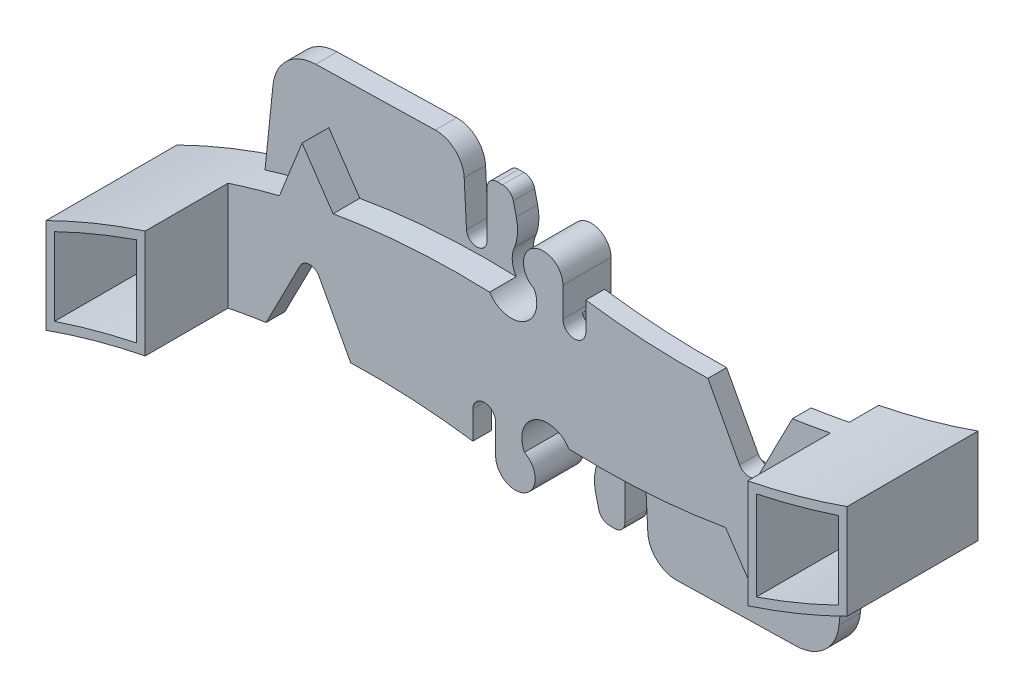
ISO-10303-21;
HEADER;
FILE_DESCRIPTION(('STEP AP214'),'2;1');
FILE_NAME('part.step','',(''),(''),'','','');
FILE_SCHEMA(('AUTOMOTIVE_DESIGN { 1 0 10303 214 1 1 1 1 }'));
ENDSEC;
DATA;
#1=APPLICATION_CONTEXT('core data for automotive mechanical design processes');
#2=APPLICATION_PROTOCOL_DEFINITION('international standard','automotive_design',2000,#1);
#3=PRODUCT_CONTEXT('',#1,'mechanical');
#4=PRODUCT('Part','Part','',(#3));
#5=PRODUCT_RELATED_PRODUCT_CATEGORY('part','',(#4));
#6=PRODUCT_DEFINITION_FORMATION('','',#4);
#7=PRODUCT_DEFINITION_CONTEXT('part definition',#1,'design');
#8=PRODUCT_DEFINITION('design','',#6,#7);
#9=PRODUCT_DEFINITION_SHAPE('','',#8);
#10=(LENGTH_UNIT() NAMED_UNIT(*) SI_UNIT(.MILLI.,.METRE.));
#11=(NAMED_UNIT(*) PLANE_ANGLE_UNIT() SI_UNIT($,.RADIAN.));
#12=(NAMED_UNIT(*) SI_UNIT($,.STERADIAN.) SOLID_ANGLE_UNIT());
#13=UNCERTAINTY_MEASURE_WITH_UNIT(LENGTH_MEASURE(1.E-05),#10,'distance_accuracy_value','');
#14=(GEOMETRIC_REPRESENTATION_CONTEXT(3) GLOBAL_UNCERTAINTY_ASSIGNED_CONTEXT((#13)) GLOBAL_UNIT_ASSIGNED_CONTEXT((#10,
#11,#12)) REPRESENTATION_CONTEXT('',''));
#15=CARTESIAN_POINT('',(0.,0.,0.));
#16=DIRECTION('',(0.,0.,1.));
#17=DIRECTION('',(1.,0.,0.));
#18=AXIS2_PLACEMENT_3D('',#15,#16,#17);
#19=CARTESIAN_POINT('',(-6.46410545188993,-65.3414908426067,2.25));
#20=DIRECTION('',(0.,0.,1.));
#21=DIRECTION('',(1.,0.,0.));
#22=AXIS2_PLACEMENT_3D('',#19,#20,#21);
#23=PLANE('',#22);
#24=CARTESIAN_POINT('',(-6.46410545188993,-65.3414908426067,2.25));
#25=DIRECTION('',(0.,0.,1.));
#26=DIRECTION('',(1.,0.,0.));
#27=AXIS2_PLACEMENT_3D('',#24,#25,#26);
#28=CIRCLE('',#27,69.8964644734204);
#29=CARTESIAN_POINT('',(-23.3919489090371,2.47417004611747,2.25));
#30=VERTEX_POINT('',#29);
#31=CARTESIAN_POINT('',(-28.2,1.08942540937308,2.25));
#32=VERTEX_POINT('',#31);
#33=EDGE_CURVE('E849',#30,#32,#28,.T.);
#34=ORIENTED_EDGE('',*,*,#33,.T.);
#35=DIRECTION('',(0.,-1.,0.));
#36=VECTOR('',#35,1.);
#37=CARTESIAN_POINT('',(-28.1999999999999,-65.3414908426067,2.25));
#38=LINE('',#37,#36);
#39=CARTESIAN_POINT('',(-28.2,-9.03879804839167,2.25));
#40=VERTEX_POINT('',#39);
#41=EDGE_CURVE('E626',#32,#40,#38,.T.);
#42=ORIENTED_EDGE('',*,*,#41,.T.);
#43=CARTESIAN_POINT('',(-14.7622564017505,-75.8940232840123,2.25));
#44=DIRECTION('',(0.,0.,-1.));
#45=DIRECTION('',(1.,0.,0.));
#46=AXIS2_PLACEMENT_3D('',#43,#44,#45);
#47=CIRCLE('',#46,68.1923316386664);
#48=CARTESIAN_POINT('',(-24.6300467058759,-8.41942948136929,2.25));
#49=VERTEX_POINT('',#48);
#50=EDGE_CURVE('E852',#40,#49,#47,.T.);
#51=ORIENTED_EDGE('',*,*,#50,.T.);
#52=DIRECTION('',(0.456375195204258,0.889787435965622,0.));
#53=VECTOR('',#52,1.);
#54=CARTESIAN_POINT('',(-21.4458020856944,-2.21115855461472,2.25));
#55=LINE('',#54,#53);
#56=CARTESIAN_POINT('',(-21.4458020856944,-2.21115855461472,2.25));
#57=VERTEX_POINT('',#56);
#58=EDGE_CURVE('E855',#49,#57,#55,.T.);
#59=ORIENTED_EDGE('',*,*,#58,.T.);
#60=CARTESIAN_POINT('',(-20.5611129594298,-2.68536103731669,2.25));
#61=DIRECTION('',(0.,0.,-1.));
#62=DIRECTION('',(1.,0.,0.));
#63=AXIS2_PLACEMENT_3D('',#60,#61,#62);
#64=CIRCLE('',#63,1.00376433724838);
#65=CARTESIAN_POINT('',(-19.6764238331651,-2.21115855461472,2.25));
#66=VERTEX_POINT('',#65);
#67=EDGE_CURVE('E857',#57,#66,#64,.T.);
#68=ORIENTED_EDGE('',*,*,#67,.T.);
#69=DIRECTION('',(0.472424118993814,-0.881371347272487,0.));
#70=VECTOR('',#69,1.);
#71=CARTESIAN_POINT('',(-16.7183998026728,-7.72975407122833,2.25));
#72=LINE('',#71,#70);
#73=CARTESIAN_POINT('',(-16.7183998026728,-7.72975407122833,2.25));
#74=VERTEX_POINT('',#73);
#75=EDGE_CURVE('E859',#66,#74,#72,.T.);
#76=ORIENTED_EDGE('',*,*,#75,.T.);
#77=CARTESIAN_POINT('',(-14.7622564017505,-75.8940232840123,2.25));
#78=DIRECTION('',(0.,0.,-1.));
#79=DIRECTION('',(1.,0.,0.));
#80=AXIS2_PLACEMENT_3D('',#77,#78,#79);
#81=CIRCLE('',#80,68.1923316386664);
#82=CARTESIAN_POINT('',(-5.28148141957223,-8.36396331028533,2.25));
#83=VERTEX_POINT('',#82);
#84=EDGE_CURVE('E861',#74,#83,#81,.T.);
#85=ORIENTED_EDGE('',*,*,#84,.T.);
#86=DIRECTION('',(0.,1.,0.));
#87=VECTOR('',#86,1.);
#88=CARTESIAN_POINT('',(-5.28148141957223,-8.36396331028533,2.25));
#89=LINE('',#88,#87);
#90=CARTESIAN_POINT('',(-5.28148141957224,-5.75287291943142,2.25));
#91=VERTEX_POINT('',#90);
#92=EDGE_CURVE('E863',#83,#91,#89,.T.);
#93=ORIENTED_EDGE('',*,*,#92,.T.);
#94=CARTESIAN_POINT('',(-4.21574070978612,-5.75287291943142,2.25));
#95=DIRECTION('',(0.,0.,-1.));
#96=DIRECTION('',(1.,0.,0.));
#97=AXIS2_PLACEMENT_3D('',#94,#95,#96);
#98=CIRCLE('',#97,1.06574070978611);
#99=CARTESIAN_POINT('',(-3.15000000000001,-5.75287291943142,2.25));
#100=VERTEX_POINT('',#99);
#101=EDGE_CURVE('E865',#91,#100,#98,.T.);
#102=ORIENTED_EDGE('',*,*,#101,.T.);
#103=DIRECTION('',(0.,-1.,0.));
#104=VECTOR('',#103,1.);
#105=CARTESIAN_POINT('',(-3.15000000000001,-5.75287291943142,2.25));
#106=LINE('',#105,#104);
#107=CARTESIAN_POINT('',(-3.15000000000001,-8.5,2.25));
#108=VERTEX_POINT('',#107);
#109=EDGE_CURVE('E867',#100,#108,#106,.T.);
#110=ORIENTED_EDGE('',*,*,#109,.T.);
#111=CARTESIAN_POINT('',(-1.3,-8.5,2.25));
#112=DIRECTION('',(0.,0.,1.));
#113=DIRECTION('',(1.,0.,0.));
#114=AXIS2_PLACEMENT_3D('',#111,#112,#113);
#115=CIRCLE('',#114,1.85);
#116=CARTESIAN_POINT('',(-0.456399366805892,-6.85353774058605,2.25));
#117=VERTEX_POINT('',#116);
#118=EDGE_CURVE('E869',#108,#117,#115,.T.);
#119=ORIENTED_EDGE('',*,*,#118,.T.);
#120=CARTESIAN_POINT('',(1.7,-5.8,2.25));
#121=DIRECTION('',(0.,0.,-1.));
#122=DIRECTION('',(1.,0.,0.));
#123=AXIS2_PLACEMENT_3D('',#120,#121,#122);
#124=CIRCLE('',#123,2.4);
#125=CARTESIAN_POINT('',(3.71780137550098,-4.50058566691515,2.25));
#126=VERTEX_POINT('',#125);
#127=EDGE_CURVE('E871',#117,#126,#124,.T.);
#128=ORIENTED_EDGE('',*,*,#127,.T.);
#129=CARTESIAN_POINT('',(6.47462830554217,65.3414908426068,2.25));
#130=DIRECTION('',(0.,0.,-1.));
#131=DIRECTION('',(1.,0.,0.));
#132=AXIS2_PLACEMENT_3D('',#129,#130,#131);
#133=CIRCLE('',#132,69.8964644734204);
#134=CARTESIAN_POINT('',(18.3647965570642,-3.53622431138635,2.25));
#135=VERTEX_POINT('',#134);
#136=EDGE_CURVE('E742',#135,#126,#133,.T.);
#137=ORIENTED_EDGE('',*,*,#136,.F.);
#138=DIRECTION('',(-0.561884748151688,0.827215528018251,0.));
#139=VECTOR('',#138,1.);
#140=CARTESIAN_POINT('',(21.2683768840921,-7.81092075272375,2.25));
#141=LINE('',#140,#139);
#142=CARTESIAN_POINT('',(21.2683768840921,-7.81092075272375,2.25));
#143=VERTEX_POINT('',#142);
#144=EDGE_CURVE('E740',#143,#135,#141,.T.);
#145=ORIENTED_EDGE('',*,*,#144,.F.);
#146=DIRECTION('',(-0.369719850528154,-0.929143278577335,0.));
#147=VECTOR('',#146,1.);
#148=CARTESIAN_POINT('',(21.2683768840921,-7.81092075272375,2.25));
#149=LINE('',#148,#147);
#150=CARTESIAN_POINT('',(23.3907889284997,-2.47708519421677,2.25));
#151=VERTEX_POINT('',#150);
#152=EDGE_CURVE('E744',#151,#143,#149,.T.);
#153=ORIENTED_EDGE('',*,*,#152,.F.);
#154=CARTESIAN_POINT('',(6.47462830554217,65.3414908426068,2.25));
#155=DIRECTION('',(0.,0.,1.));
#156=DIRECTION('',(1.,0.,0.));
#157=AXIS2_PLACEMENT_3D('',#154,#155,#156);
#158=CIRCLE('',#157,69.8964644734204);
#159=CARTESIAN_POINT('',(28.2,-1.09286751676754,2.25));
#160=VERTEX_POINT('',#159);
#161=EDGE_CURVE('E874',#151,#160,#158,.T.);
#162=ORIENTED_EDGE('',*,*,#161,.T.);
#163=DIRECTION('',(0.,1.,0.));
#164=VECTOR('',#163,1.);
#165=CARTESIAN_POINT('',(28.2,-65.3414908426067,2.25));
#166=LINE('',#165,#164);
#167=CARTESIAN_POINT('',(28.2,9.03668384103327,2.25));
#168=VERTEX_POINT('',#167);
#169=EDGE_CURVE('E644',#160,#168,#166,.T.);
#170=ORIENTED_EDGE('',*,*,#169,.T.);
#171=CARTESIAN_POINT('',(14.7727792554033,75.8940232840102,2.25));
#172=DIRECTION('',(0.,0.,-1.));
#173=DIRECTION('',(1.,0.,0.));
#174=AXIS2_PLACEMENT_3D('',#171,#172,#173);
#175=CIRCLE('',#174,68.1923316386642);
#176=CARTESIAN_POINT('',(24.6291939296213,8.41776683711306,2.25));
#177=VERTEX_POINT('',#176);
#178=EDGE_CURVE('E877',#168,#177,#175,.T.);
#179=ORIENTED_EDGE('',*,*,#178,.T.);
#180=DIRECTION('',(-0.456375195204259,-0.889787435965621,0.));
#181=VECTOR('',#180,1.);
#182=CARTESIAN_POINT('',(21.4458020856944,2.21115855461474,2.25));
#183=LINE('',#182,#181);
#184=CARTESIAN_POINT('',(21.4458020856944,2.21115855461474,2.25));
#185=VERTEX_POINT('',#184);
#186=EDGE_CURVE('E879',#177,#185,#183,.T.);
#187=ORIENTED_EDGE('',*,*,#186,.T.);
#188=CARTESIAN_POINT('',(20.5611129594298,2.68536103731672,2.25));
#189=DIRECTION('',(0.,0.,-1.));
#190=DIRECTION('',(1.,0.,0.));
#191=AXIS2_PLACEMENT_3D('',#188,#189,#190);
#192=CIRCLE('',#191,1.00376433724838);
#193=CARTESIAN_POINT('',(19.6764238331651,2.21115855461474,2.25));
#194=VERTEX_POINT('',#193);
#195=EDGE_CURVE('E881',#185,#194,#192,.T.);
#196=ORIENTED_EDGE('',*,*,#195,.T.);
#197=DIRECTION('',(-0.472424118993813,0.881371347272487,0.));
#198=VECTOR('',#197,1.);
#199=CARTESIAN_POINT('',(16.7185587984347,7.72945744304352,2.25));
#200=LINE('',#199,#198);
#201=CARTESIAN_POINT('',(16.7185587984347,7.72945744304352,2.25));
#202=VERTEX_POINT('',#201);
#203=EDGE_CURVE('E883',#194,#202,#200,.T.);
#204=ORIENTED_EDGE('',*,*,#203,.T.);
#205=CARTESIAN_POINT('',(14.7727792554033,75.8940232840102,2.25));
#206=DIRECTION('',(0.,0.,-1.));
#207=DIRECTION('',(1.,0.,0.));
#208=AXIS2_PLACEMENT_3D('',#205,#206,#207);
#209=CIRCLE('',#208,68.1923316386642);
#210=CARTESIAN_POINT('',(5.2920042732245,8.36396331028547,2.25));
#211=VERTEX_POINT('',#210);
#212=EDGE_CURVE('E885',#202,#211,#209,.T.);
#213=ORIENTED_EDGE('',*,*,#212,.T.);
#214=DIRECTION('',(0.,-1.,0.));
#215=VECTOR('',#214,1.);
#216=CARTESIAN_POINT('',(5.29200427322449,8.36396331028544,2.25));
#217=LINE('',#216,#215);
#218=CARTESIAN_POINT('',(5.29200427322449,5.75287291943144,2.25));
#219=VERTEX_POINT('',#218);
#220=EDGE_CURVE('E887',#211,#219,#217,.T.);
#221=ORIENTED_EDGE('',*,*,#220,.T.);
#222=CARTESIAN_POINT('',(4.22100213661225,5.75287291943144,2.25));
#223=DIRECTION('',(0.,0.,-1.));
#224=DIRECTION('',(1.,0.,0.));
#225=AXIS2_PLACEMENT_3D('',#222,#223,#224);
#226=CIRCLE('',#225,1.07100213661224);
#227=CARTESIAN_POINT('',(3.15000000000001,5.75287291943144,2.25));
#228=VERTEX_POINT('',#227);
#229=EDGE_CURVE('E889',#219,#228,#226,.T.);
#230=ORIENTED_EDGE('',*,*,#229,.T.);
#231=DIRECTION('',(0.,1.,0.));
#232=VECTOR('',#231,1.);
#233=CARTESIAN_POINT('',(3.15000000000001,5.75287291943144,2.25));
#234=LINE('',#233,#232);
#235=CARTESIAN_POINT('',(3.15,8.50000000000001,2.25));
#236=VERTEX_POINT('',#235);
#237=EDGE_CURVE('E891',#228,#236,#234,.T.);
#238=ORIENTED_EDGE('',*,*,#237,.T.);
#239=CARTESIAN_POINT('',(1.3,8.50000000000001,2.25));
#240=DIRECTION('',(0.,0.,1.));
#241=DIRECTION('',(1.,0.,0.));
#242=AXIS2_PLACEMENT_3D('',#239,#240,#241);
#243=CIRCLE('',#242,1.85);
#244=CARTESIAN_POINT('',(0.456399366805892,6.85353774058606,2.25));
#245=VERTEX_POINT('',#244);
#246=EDGE_CURVE('E893',#236,#245,#243,.T.);
#247=ORIENTED_EDGE('',*,*,#246,.T.);
#248=CARTESIAN_POINT('',(-1.7,5.80000000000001,2.25));
#249=DIRECTION('',(0.,0.,-1.));
#250=DIRECTION('',(1.,0.,0.));
#251=AXIS2_PLACEMENT_3D('',#248,#249,#250);
#252=CIRCLE('',#251,2.4);
#253=CARTESIAN_POINT('',(-3.7180752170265,4.50101100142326,2.25));
#254=VERTEX_POINT('',#253);
#255=EDGE_CURVE('E895',#245,#254,#252,.T.);
#256=ORIENTED_EDGE('',*,*,#255,.T.);
#257=CARTESIAN_POINT('',(-6.46410545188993,-65.3414908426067,2.25));
#258=DIRECTION('',(0.,0.,-1.));
#259=DIRECTION('',(1.,0.,0.));
#260=AXIS2_PLACEMENT_3D('',#257,#258,#259);
#261=CIRCLE('',#260,69.8964644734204);
#262=CARTESIAN_POINT('',(-18.363691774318,3.53459783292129,2.25));
#263=VERTEX_POINT('',#262);
#264=EDGE_CURVE('E795',#263,#254,#261,.T.);
#265=ORIENTED_EDGE('',*,*,#264,.F.);
#266=DIRECTION('',(0.561884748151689,-0.827215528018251,0.));
#267=VECTOR('',#266,1.);
#268=CARTESIAN_POINT('',(-21.2683768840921,7.81092075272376,2.25));
#269=LINE('',#268,#267);
#270=CARTESIAN_POINT('',(-21.2683768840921,7.81092075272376,2.25));
#271=VERTEX_POINT('',#270);
#272=EDGE_CURVE('E800',#271,#263,#269,.T.);
#273=ORIENTED_EDGE('',*,*,#272,.F.);
#274=DIRECTION('',(0.369719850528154,0.929143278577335,0.));
#275=VECTOR('',#274,1.);
#276=CARTESIAN_POINT('',(-21.2683768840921,7.81092075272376,2.25));
#277=LINE('',#276,#275);
#278=EDGE_CURVE('E797',#30,#271,#277,.T.);
#279=ORIENTED_EDGE('',*,*,#278,.F.);
#280=EDGE_LOOP('',(#34,#42,#51,#59,#68,#76,#85,#93,#102,#110,#119,#128,#137,#145,#153,#162,#170,
#179,#187,#196,#204,#213,#221,#230,#238,#247,#256,#265,#273,#279));
#281=FACE_BOUND('',#280,.T.);
#282=ADVANCED_FACE('F37',(#281),#23,.T.);
#283=CARTESIAN_POINT('',(-6.46410545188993,-65.3414908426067,-2.25));
#284=DIRECTION('',(0.,0.,1.));
#285=DIRECTION('',(1.,0.,0.));
#286=AXIS2_PLACEMENT_3D('',#283,#284,#285);
#287=PLANE('',#286);
#288=DIRECTION('',(-0.877777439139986,0.479068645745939,0.));
#289=VECTOR('',#288,1.);
#290=CARTESIAN_POINT('',(12.2244121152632,-31.0993018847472,-2.25));
#291=LINE('',#290,#289);
#292=CARTESIAN_POINT('',(-28.1971687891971,-9.0382290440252,-2.25));
#293=VERTEX_POINT('',#292);
#294=CARTESIAN_POINT('',(-28.2,-9.03668384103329,-2.25));
#295=VERTEX_POINT('',#294);
#296=EDGE_CURVE('E693',#293,#295,#291,.T.);
#297=ORIENTED_EDGE('',*,*,#296,.F.);
#298=CARTESIAN_POINT('',(-14.7622564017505,-75.8940232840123,-2.25));
#299=DIRECTION('',(0.,0.,-1.));
#300=DIRECTION('',(1.,0.,0.));
#301=AXIS2_PLACEMENT_3D('',#298,#299,#300);
#302=CIRCLE('',#301,68.1923316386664);
#303=CARTESIAN_POINT('',(-37.4894771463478,-11.6004191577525,-2.25));
#304=VERTEX_POINT('',#303);
#305=EDGE_CURVE('E904',#304,#293,#302,.T.);
#306=ORIENTED_EDGE('',*,*,#305,.F.);
#307=DIRECTION('',(0.,-1.,0.));
#308=VECTOR('',#307,1.);
#309=CARTESIAN_POINT('',(-37.4894771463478,-2.70809673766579,-2.25));
#310=LINE('',#309,#308);
#311=CARTESIAN_POINT('',(-37.4894771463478,-2.70809673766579,-2.25));
#312=VERTEX_POINT('',#311);
#313=EDGE_CURVE('E901',#312,#304,#310,.T.);
#314=ORIENTED_EDGE('',*,*,#313,.F.);
#315=CARTESIAN_POINT('',(-6.46410545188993,-65.3414908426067,-2.25));
#316=DIRECTION('',(0.,0.,1.));
#317=DIRECTION('',(1.,0.,0.));
#318=AXIS2_PLACEMENT_3D('',#315,#316,#317);
#319=CIRCLE('',#318,69.8964644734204);
#320=CARTESIAN_POINT('',(-27.2374537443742,1.39668224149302,-2.25));
#321=VERTEX_POINT('',#320);
#322=EDGE_CURVE('E848',#321,#312,#319,.T.);
#323=ORIENTED_EDGE('',*,*,#322,.F.);
#324=DIRECTION('',(-0.102126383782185,-0.994771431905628,0.));
#325=VECTOR('',#324,1.);
#326=CARTESIAN_POINT('',(-27.2374537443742,1.39668224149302,-2.25));
#327=LINE('',#326,#325);
#328=CARTESIAN_POINT('',(-26.4936918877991,8.64136299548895,-2.25));
#329=VERTEX_POINT('',#328);
#330=EDGE_CURVE('E853',#329,#321,#327,.T.);
#331=ORIENTED_EDGE('',*,*,#330,.F.);
#332=CARTESIAN_POINT('',(-22.3954367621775,8.22062315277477,-2.25));
#333=DIRECTION('',(0.,0.,1.));
#334=DIRECTION('',(1.,0.,0.));
#335=AXIS2_PLACEMENT_3D('',#332,#333,#334);
#336=CIRCLE('',#335,4.11979575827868);
#337=CARTESIAN_POINT('',(-22.4926083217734,12.3392727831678,-2.25));
#338=VERTEX_POINT('',#337);
#339=EDGE_CURVE('E1000',#338,#329,#336,.T.);
#340=ORIENTED_EDGE('',*,*,#339,.F.);
#341=DIRECTION('',(-0.999721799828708,-0.0235864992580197,0.));
#342=VECTOR('',#341,1.);
#343=CARTESIAN_POINT('',(-22.4926083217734,12.3392727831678,-2.25));
#344=LINE('',#343,#342);
#345=CARTESIAN_POINT('',(-11.3070185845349,12.6031751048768,-2.25));
#346=VERTEX_POINT('',#345);
#347=EDGE_CURVE('E997',#346,#338,#344,.T.);
#348=ORIENTED_EDGE('',*,*,#347,.F.);
#349=CARTESIAN_POINT('',(-11.2444183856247,9.94984436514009,-2.25));
#350=DIRECTION('',(0.,0.,1.));
#351=DIRECTION('',(1.,0.,0.));
#352=AXIS2_PLACEMENT_3D('',#349,#350,#351);
#353=CIRCLE('',#352,2.65406910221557);
#354=CARTESIAN_POINT('',(-8.59390155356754,10.087115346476,-2.25));
#355=VERTEX_POINT('',#354);
#356=EDGE_CURVE('E994',#355,#346,#353,.T.);
#357=ORIENTED_EDGE('',*,*,#356,.F.);
#358=DIRECTION('',(-0.0517209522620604,0.998661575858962,0.));
#359=VECTOR('',#358,1.);
#360=CARTESIAN_POINT('',(-8.59390155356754,10.087115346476,-2.25));
#361=LINE('',#360,#359);
#362=CARTESIAN_POINT('',(-8.38130233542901,5.9821122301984,-2.25));
#363=VERTEX_POINT('',#362);
#364=EDGE_CURVE('E991',#363,#355,#361,.T.);
#365=ORIENTED_EDGE('',*,*,#364,.F.);
#366=CARTESIAN_POINT('',(-7.41809653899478,6.03199691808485,-2.25));
#367=DIRECTION('',(0.,0.,-1.));
#368=DIRECTION('',(1.,0.,0.));
#369=AXIS2_PLACEMENT_3D('',#366,#367,#368);
#370=CIRCLE('',#369,0.964496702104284);
#371=CARTESIAN_POINT('',(-6.4535998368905,6.03199691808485,-2.25));
#372=VERTEX_POINT('',#371);
#373=EDGE_CURVE('E988',#372,#363,#370,.T.);
#374=ORIENTED_EDGE('',*,*,#373,.F.);
#375=DIRECTION('',(0.,-1.,0.));
#376=VECTOR('',#375,1.);
#377=CARTESIAN_POINT('',(-6.4535998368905,6.03199691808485,-2.25));
#378=LINE('',#377,#376);
#379=CARTESIAN_POINT('',(-6.45359983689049,10.3541587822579,-2.25));
#380=VERTEX_POINT('',#379);
#381=EDGE_CURVE('E985',#380,#372,#378,.T.);
#382=ORIENTED_EDGE('',*,*,#381,.F.);
#383=CARTESIAN_POINT('',(-5.49859125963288,10.3541587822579,-2.25));
#384=DIRECTION('',(0.,0.,1.));
#385=DIRECTION('',(1.,0.,0.));
#386=AXIS2_PLACEMENT_3D('',#383,#384,#385);
#387=CIRCLE('',#386,0.955008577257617);
#388=CARTESIAN_POINT('',(-5.49859125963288,11.3091673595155,-2.25));
#389=VERTEX_POINT('',#388);
#390=EDGE_CURVE('E982',#389,#380,#387,.T.);
#391=ORIENTED_EDGE('',*,*,#390,.F.);
#392=DIRECTION('',(-1.,0.,0.));
#393=VECTOR('',#392,1.);
#394=CARTESIAN_POINT('',(-5.49859125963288,11.3091673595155,-2.25));
#395=LINE('',#394,#393);
#396=CARTESIAN_POINT('',(-5.00582213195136,11.3091673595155,-2.25));
#397=VERTEX_POINT('',#396);
#398=EDGE_CURVE('E979',#397,#389,#395,.T.);
#399=ORIENTED_EDGE('',*,*,#398,.F.);
#400=CARTESIAN_POINT('',(-5.00582213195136,10.2727717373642,-2.25));
#401=DIRECTION('',(0.,0.,1.));
#402=DIRECTION('',(1.,0.,0.));
#403=AXIS2_PLACEMENT_3D('',#400,#401,#402);
#404=CIRCLE('',#403,1.03639562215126);
#405=CARTESIAN_POINT('',(-3.99760960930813,10.5128204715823,-2.25));
#406=VERTEX_POINT('',#405);
#407=EDGE_CURVE('E976',#406,#397,#404,.T.);
#408=ORIENTED_EDGE('',*,*,#407,.F.);
#409=DIRECTION('',(-0.231618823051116,0.972806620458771,0.));
#410=VECTOR('',#409,1.);
#411=CARTESIAN_POINT('',(-3.99760960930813,10.5128204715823,-2.25));
#412=LINE('',#411,#410);
#413=CARTESIAN_POINT('',(-3.71780137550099,9.33761675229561,-2.25));
#414=VERTEX_POINT('',#413);
#415=EDGE_CURVE('E973',#414,#406,#412,.T.);
#416=ORIENTED_EDGE('',*,*,#415,.F.);
#417=CARTESIAN_POINT('',(-7.93761919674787,8.33290603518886,-2.25));
#418=DIRECTION('',(0.,0.,1.));
#419=DIRECTION('',(1.,0.,0.));
#420=AXIS2_PLACEMENT_3D('',#417,#418,#419);
#421=CIRCLE('',#420,4.33777662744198);
#422=CARTESIAN_POINT('',(-3.87132673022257,6.8224188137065,-2.25));
#423=VERTEX_POINT('',#422);
#424=EDGE_CURVE('E970',#423,#414,#421,.T.);
#425=ORIENTED_EDGE('',*,*,#424,.F.);
#426=CARTESIAN_POINT('',(-1.7,5.80000000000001,-2.25));
#427=DIRECTION('',(0.,0.,-1.));
#428=DIRECTION('',(1.,0.,0.));
#429=AXIS2_PLACEMENT_3D('',#426,#427,#428);
#430=CIRCLE('',#429,2.4);
#431=CARTESIAN_POINT('',(0.456399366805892,6.85353774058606,-2.25));
#432=VERTEX_POINT('',#431);
#433=EDGE_CURVE('E967',#432,#423,#430,.T.);
#434=ORIENTED_EDGE('',*,*,#433,.F.);
#435=CARTESIAN_POINT('',(1.3,8.50000000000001,-2.25));
#436=DIRECTION('',(0.,0.,1.));
#437=DIRECTION('',(1.,0.,0.));
#438=AXIS2_PLACEMENT_3D('',#435,#436,#437);
#439=CIRCLE('',#438,1.85);
#440=CARTESIAN_POINT('',(3.15,8.50000000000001,-2.25));
#441=VERTEX_POINT('',#440);
#442=EDGE_CURVE('E965',#441,#432,#439,.T.);
#443=ORIENTED_EDGE('',*,*,#442,.F.);
#444=DIRECTION('',(0.,1.,0.));
#445=VECTOR('',#444,1.);
#446=CARTESIAN_POINT('',(3.15000000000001,5.75287291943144,-2.25));
#447=LINE('',#446,#445);
#448=CARTESIAN_POINT('',(3.15000000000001,5.75287291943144,-2.25));
#449=VERTEX_POINT('',#448);
#450=EDGE_CURVE('E963',#449,#441,#447,.T.);
#451=ORIENTED_EDGE('',*,*,#450,.F.);
#452=CARTESIAN_POINT('',(4.22100213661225,5.75287291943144,-2.25));
#453=DIRECTION('',(0.,0.,-1.));
#454=DIRECTION('',(1.,0.,0.));
#455=AXIS2_PLACEMENT_3D('',#452,#453,#454);
#456=CIRCLE('',#455,1.07100213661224);
#457=CARTESIAN_POINT('',(3.2,5.42945335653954,-2.25));
#458=VERTEX_POINT('',#457);
#459=EDGE_CURVE('E961',#458,#449,#456,.T.);
#460=ORIENTED_EDGE('',*,*,#459,.F.);
#461=DIRECTION('',(0.,1.,0.));
#462=VECTOR('',#461,1.);
#463=CARTESIAN_POINT('',(3.2,-65.3414908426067,-2.25));
#464=LINE('',#463,#462);
#465=CARTESIAN_POINT('',(3.2,2.21030441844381,-2.25));
#466=VERTEX_POINT('',#465);
#467=EDGE_CURVE('E1124',#466,#458,#464,.T.);
#468=ORIENTED_EDGE('',*,*,#467,.F.);
#469=CARTESIAN_POINT('',(5.7,2.21030441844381,-2.25));
#470=DIRECTION('',(0.,0.,1.));
#471=DIRECTION('',(1.,0.,0.));
#472=AXIS2_PLACEMENT_3D('',#469,#470,#471);
#473=CIRCLE('',#472,2.5);
#474=CARTESIAN_POINT('',(5.57166232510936,-0.286399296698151,-2.25));
#475=VERTEX_POINT('',#474);
#476=EDGE_CURVE('E1122',#475,#466,#473,.F.);
#477=ORIENTED_EDGE('',*,*,#476,.F.);
#478=DIRECTION('',(-0.998681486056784,0.0513350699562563,0.));
#479=VECTOR('',#478,1.);
#480=CARTESIAN_POINT('',(-3.09718336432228,0.159204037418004,-2.25));
#481=LINE('',#480,#479);
#482=CARTESIAN_POINT('',(23.4689921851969,-1.20637297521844,-2.25));
#483=VERTEX_POINT('',#482);
#484=EDGE_CURVE('E1120',#483,#475,#481,.T.);
#485=ORIENTED_EDGE('',*,*,#484,.F.);
#486=CARTESIAN_POINT('',(23.7,3.28769371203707,-2.25));
#487=DIRECTION('',(0.,0.,1.));
#488=DIRECTION('',(1.,0.,0.));
#489=AXIS2_PLACEMENT_3D('',#486,#487,#488);
#490=CIRCLE('',#489,4.5);
#491=CARTESIAN_POINT('',(28.2,3.28769371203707,-2.25));
#492=VERTEX_POINT('',#491);
#493=EDGE_CURVE('E1126',#492,#483,#490,.F.);
#494=ORIENTED_EDGE('',*,*,#493,.F.);
#495=DIRECTION('',(0.,-1.,0.));
#496=VECTOR('',#495,1.);
#497=CARTESIAN_POINT('',(28.2000000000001,-65.3414908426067,-2.25));
#498=LINE('',#497,#496);
#499=CARTESIAN_POINT('',(28.2,9.03668384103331,-2.25));
#500=VERTEX_POINT('',#499);
#501=EDGE_CURVE('E1129',#500,#492,#498,.T.);
#502=ORIENTED_EDGE('',*,*,#501,.F.);
#503=CARTESIAN_POINT('',(14.7727792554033,75.8940232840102,-2.25));
#504=DIRECTION('',(0.,0.,-1.));
#505=DIRECTION('',(1.,0.,0.));
#506=AXIS2_PLACEMENT_3D('',#503,#504,#505);
#507=CIRCLE('',#506,68.1923316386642);
#508=CARTESIAN_POINT('',(37.5,11.6004191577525,-2.25));
#509=VERTEX_POINT('',#508);
#510=EDGE_CURVE('E958',#509,#500,#507,.T.);
#511=ORIENTED_EDGE('',*,*,#510,.F.);
#512=DIRECTION('',(0.,1.,0.));
#513=VECTOR('',#512,1.);
#514=CARTESIAN_POINT('',(37.5,2.70809673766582,-2.25));
#515=LINE('',#514,#513);
#516=CARTESIAN_POINT('',(37.5,2.70809673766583,-2.25));
#517=VERTEX_POINT('',#516);
#518=EDGE_CURVE('E955',#517,#509,#515,.T.);
#519=ORIENTED_EDGE('',*,*,#518,.F.);
#520=CARTESIAN_POINT('',(6.47462830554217,65.3414908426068,-2.25));
#521=DIRECTION('',(0.,0.,1.));
#522=DIRECTION('',(1.,0.,0.));
#523=AXIS2_PLACEMENT_3D('',#520,#521,#522);
#524=CIRCLE('',#523,69.8964644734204);
#525=CARTESIAN_POINT('',(27.2371064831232,-1.40006477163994,-2.25));
#526=VERTEX_POINT('',#525);
#527=EDGE_CURVE('E952',#526,#517,#524,.T.);
#528=ORIENTED_EDGE('',*,*,#527,.F.);
#529=DIRECTION('',(0.102126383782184,0.994771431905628,0.));
#530=VECTOR('',#529,1.);
#531=CARTESIAN_POINT('',(27.2371064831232,-1.40006477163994,-2.25));
#532=LINE('',#531,#530);
#533=CARTESIAN_POINT('',(26.4936918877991,-8.64136299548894,-2.25));
#534=VERTEX_POINT('',#533);
#535=EDGE_CURVE('E949',#534,#526,#532,.T.);
#536=ORIENTED_EDGE('',*,*,#535,.F.);
#537=CARTESIAN_POINT('',(22.3954367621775,-8.22062315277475,-2.25));
#538=DIRECTION('',(0.,0.,1.));
#539=DIRECTION('',(1.,0.,0.));
#540=AXIS2_PLACEMENT_3D('',#537,#538,#539);
#541=CIRCLE('',#540,4.11979575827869);
#542=CARTESIAN_POINT('',(22.4926083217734,-12.3392727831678,-2.25));
#543=VERTEX_POINT('',#542);
#544=EDGE_CURVE('E946',#543,#534,#541,.T.);
#545=ORIENTED_EDGE('',*,*,#544,.F.);
#546=DIRECTION('',(0.999721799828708,0.0235864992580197,0.));
#547=VECTOR('',#546,1.);
#548=CARTESIAN_POINT('',(22.4926083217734,-12.3392727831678,-2.25));
#549=LINE('',#548,#547);
#550=CARTESIAN_POINT('',(11.3070185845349,-12.6031751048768,-2.25));
#551=VERTEX_POINT('',#550);
#552=EDGE_CURVE('E943',#551,#543,#549,.T.);
#553=ORIENTED_EDGE('',*,*,#552,.F.);
#554=CARTESIAN_POINT('',(11.2444183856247,-9.94984436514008,-2.25));
#555=DIRECTION('',(0.,0.,1.));
#556=DIRECTION('',(1.,0.,0.));
#557=AXIS2_PLACEMENT_3D('',#554,#555,#556);
#558=CIRCLE('',#557,2.65406910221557);
#559=CARTESIAN_POINT('',(8.59390155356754,-10.087115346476,-2.25));
#560=VERTEX_POINT('',#559);
#561=EDGE_CURVE('E940',#560,#551,#558,.T.);
#562=ORIENTED_EDGE('',*,*,#561,.F.);
#563=DIRECTION('',(0.0517209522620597,-0.998661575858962,0.));
#564=VECTOR('',#563,1.);
#565=CARTESIAN_POINT('',(8.59390155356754,-10.087115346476,-2.25));
#566=LINE('',#565,#564);
#567=CARTESIAN_POINT('',(8.38130233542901,-5.98211223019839,-2.25));
#568=VERTEX_POINT('',#567);
#569=EDGE_CURVE('E937',#568,#560,#566,.T.);
#570=ORIENTED_EDGE('',*,*,#569,.F.);
#571=CARTESIAN_POINT('',(7.41809653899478,-6.03199691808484,-2.25));
#572=DIRECTION('',(0.,0.,-1.));
#573=DIRECTION('',(1.,0.,0.));
#574=AXIS2_PLACEMENT_3D('',#571,#572,#573);
#575=CIRCLE('',#574,0.964496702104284);
#576=CARTESIAN_POINT('',(6.4535998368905,-6.03199691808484,-2.25));
#577=VERTEX_POINT('',#576);
#578=EDGE_CURVE('E934',#577,#568,#575,.T.);
#579=ORIENTED_EDGE('',*,*,#578,.F.);
#580=DIRECTION('',(0.,1.,0.));
#581=VECTOR('',#580,1.);
#582=CARTESIAN_POINT('',(6.4535998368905,-6.03199691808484,-2.25));
#583=LINE('',#582,#581);
#584=CARTESIAN_POINT('',(6.45359983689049,-10.3541587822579,-2.25));
#585=VERTEX_POINT('',#584);
#586=EDGE_CURVE('E931',#585,#577,#583,.T.);
#587=ORIENTED_EDGE('',*,*,#586,.F.);
#588=CARTESIAN_POINT('',(5.49859125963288,-10.3541587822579,-2.25));
#589=DIRECTION('',(0.,0.,1.));
#590=DIRECTION('',(1.,0.,0.));
#591=AXIS2_PLACEMENT_3D('',#588,#589,#590);
#592=CIRCLE('',#591,0.955008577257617);
#593=CARTESIAN_POINT('',(5.49859125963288,-11.3091673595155,-2.25));
#594=VERTEX_POINT('',#593);
#595=EDGE_CURVE('E928',#594,#585,#592,.T.);
#596=ORIENTED_EDGE('',*,*,#595,.F.);
#597=DIRECTION('',(1.,0.,0.));
#598=VECTOR('',#597,1.);
#599=CARTESIAN_POINT('',(5.49859125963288,-11.3091673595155,-2.25));
#600=LINE('',#599,#598);
#601=CARTESIAN_POINT('',(5.00582213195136,-11.3091673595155,-2.25));
#602=VERTEX_POINT('',#601);
#603=EDGE_CURVE('E925',#602,#594,#600,.T.);
#604=ORIENTED_EDGE('',*,*,#603,.F.);
#605=CARTESIAN_POINT('',(5.00582213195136,-10.2727717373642,-2.25));
#606=DIRECTION('',(0.,0.,1.));
#607=DIRECTION('',(1.,0.,0.));
#608=AXIS2_PLACEMENT_3D('',#605,#606,#607);
#609=CIRCLE('',#608,1.03639562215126);
#610=CARTESIAN_POINT('',(3.99760960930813,-10.5128204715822,-2.25));
#611=VERTEX_POINT('',#610);
#612=EDGE_CURVE('E922',#611,#602,#609,.T.);
#613=ORIENTED_EDGE('',*,*,#612,.F.);
#614=DIRECTION('',(0.231618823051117,-0.972806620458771,0.));
#615=VECTOR('',#614,1.);
#616=CARTESIAN_POINT('',(3.99760960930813,-10.5128204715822,-2.25));
#617=LINE('',#616,#615);
#618=CARTESIAN_POINT('',(3.71780137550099,-9.3376167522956,-2.25));
#619=VERTEX_POINT('',#618);
#620=EDGE_CURVE('E919',#619,#611,#617,.T.);
#621=ORIENTED_EDGE('',*,*,#620,.F.);
#622=CARTESIAN_POINT('',(7.92676452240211,-8.33549046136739,-2.25));
#623=DIRECTION('',(0.,0.,1.));
#624=DIRECTION('',(1.,0.,0.));
#625=AXIS2_PLACEMENT_3D('',#622,#623,#624);
#626=CIRCLE('',#625,4.32661852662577);
#627=CARTESIAN_POINT('',(3.88196371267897,-6.79951706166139,-2.25));
#628=VERTEX_POINT('',#627);
#629=EDGE_CURVE('E916',#628,#619,#626,.T.);
#630=ORIENTED_EDGE('',*,*,#629,.F.);
#631=CARTESIAN_POINT('',(1.7,-5.8,-2.25));
#632=DIRECTION('',(0.,0.,-1.));
#633=DIRECTION('',(1.,0.,0.));
#634=AXIS2_PLACEMENT_3D('',#631,#632,#633);
#635=CIRCLE('',#634,2.4);
#636=CARTESIAN_POINT('',(-0.456399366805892,-6.85353774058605,-2.25));
#637=VERTEX_POINT('',#636);
#638=EDGE_CURVE('E913',#637,#628,#635,.T.);
#639=ORIENTED_EDGE('',*,*,#638,.F.);
#640=CARTESIAN_POINT('',(-1.3,-8.5,-2.25));
#641=DIRECTION('',(0.,0.,1.));
#642=DIRECTION('',(1.,0.,0.));
#643=AXIS2_PLACEMENT_3D('',#640,#641,#642);
#644=CIRCLE('',#643,1.85);
#645=CARTESIAN_POINT('',(-3.15000000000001,-8.5,-2.25));
#646=VERTEX_POINT('',#645);
#647=EDGE_CURVE('E911',#646,#637,#644,.T.);
#648=ORIENTED_EDGE('',*,*,#647,.F.);
#649=DIRECTION('',(0.,-1.,0.));
#650=VECTOR('',#649,1.);
#651=CARTESIAN_POINT('',(-3.15000000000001,-5.75287291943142,-2.25));
#652=LINE('',#651,#650);
#653=CARTESIAN_POINT('',(-3.15000000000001,-5.75287291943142,-2.25));
#654=VERTEX_POINT('',#653);
#655=EDGE_CURVE('E909',#654,#646,#652,.T.);
#656=ORIENTED_EDGE('',*,*,#655,.F.);
#657=CARTESIAN_POINT('',(-4.21574070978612,-5.75287291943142,-2.25));
#658=DIRECTION('',(0.,0.,-1.));
#659=DIRECTION('',(1.,0.,0.));
#660=AXIS2_PLACEMENT_3D('',#657,#658,#659);
#661=CIRCLE('',#660,1.06574070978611);
#662=CARTESIAN_POINT('',(-3.2,-5.43026778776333,-2.25));
#663=VERTEX_POINT('',#662);
#664=EDGE_CURVE('E907',#663,#654,#661,.T.);
#665=ORIENTED_EDGE('',*,*,#664,.F.);
#666=DIRECTION('',(0.,-1.,0.));
#667=VECTOR('',#666,1.);
#668=CARTESIAN_POINT('',(-3.2,-65.3414908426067,-2.25));
#669=LINE('',#668,#667);
#670=CARTESIAN_POINT('',(-3.2,-2.21030441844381,-2.25));
#671=VERTEX_POINT('',#670);
#672=EDGE_CURVE('E691',#671,#663,#669,.T.);
#673=ORIENTED_EDGE('',*,*,#672,.F.);
#674=CARTESIAN_POINT('',(-5.7,-2.21030441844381,-2.25));
#675=DIRECTION('',(0.,0.,1.));
#676=DIRECTION('',(1.,0.,0.));
#677=AXIS2_PLACEMENT_3D('',#674,#675,#676);
#678=CIRCLE('',#677,2.5);
#679=CARTESIAN_POINT('',(-5.57166232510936,0.286399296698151,-2.25));
#680=VERTEX_POINT('',#679);
#681=EDGE_CURVE('E1150',#680,#671,#678,.F.);
#682=ORIENTED_EDGE('',*,*,#681,.F.);
#683=DIRECTION('',(0.998681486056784,-0.0513350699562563,0.));
#684=VECTOR('',#683,1.);
#685=CARTESIAN_POINT('',(-3.09718336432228,0.159204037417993,-2.25));
#686=LINE('',#685,#684);
#687=CARTESIAN_POINT('',(-23.4689921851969,1.20637297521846,-2.25));
#688=VERTEX_POINT('',#687);
#689=EDGE_CURVE('E1148',#688,#680,#686,.T.);
#690=ORIENTED_EDGE('',*,*,#689,.F.);
#691=CARTESIAN_POINT('',(-23.7,-3.28769371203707,-2.25));
#692=DIRECTION('',(0.,0.,1.));
#693=DIRECTION('',(1.,0.,0.));
#694=AXIS2_PLACEMENT_3D('',#691,#692,#693);
#695=CIRCLE('',#694,4.5);
#696=CARTESIAN_POINT('',(-28.2,-3.28769371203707,-2.25));
#697=VERTEX_POINT('',#696);
#698=EDGE_CURVE('E1146',#697,#688,#695,.F.);
#699=ORIENTED_EDGE('',*,*,#698,.F.);
#700=DIRECTION('',(0.,1.,0.));
#701=VECTOR('',#700,1.);
#702=CARTESIAN_POINT('',(-28.1999999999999,-65.3414908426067,-2.25));
#703=LINE('',#702,#701);
#704=EDGE_CURVE('E1143',#295,#697,#703,.T.);
#705=ORIENTED_EDGE('',*,*,#704,.F.);
#706=EDGE_LOOP('',(#297,#306,#314,#323,#331,#340,#348,#357,#365,#374,#382,#391,#399,#408,#416,
#425,#434,#443,#451,#460,#468,#477,#485,#494,#502,#511,#519,#528,#536,#545,#553,#562,#570,#579,
#587,#596,#604,#613,#621,#630,#639,#648,#656,#665,#673,#682,#690,#699,#705));
#707=FACE_BOUND('',#706,.T.);
#708=ADVANCED_FACE('F1167',(#707),#287,.F.);
#709=CARTESIAN_POINT('',(-14.7622564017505,-75.8940232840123,2.25));
#710=DIRECTION('',(0.,0.,-1.));
#711=DIRECTION('',(-1.,0.,0.));
#712=AXIS2_PLACEMENT_3D('',#709,#710,#711);
#713=CYLINDRICAL_SURFACE('',#712,68.1923316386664);
#714=ORIENTED_EDGE('',*,*,#50,.F.);
#715=DIRECTION('',(0.,0.,-1.));
#716=VECTOR('',#715,1.);
#717=CARTESIAN_POINT('',(-28.2,-9.03879804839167,10.));
#718=LINE('',#717,#716);
#719=CARTESIAN_POINT('',(-28.2,-9.03879804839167,10.));
#720=VERTEX_POINT('',#719);
#721=EDGE_CURVE('E624',#720,#40,#718,.T.);
#722=ORIENTED_EDGE('',*,*,#721,.F.);
#723=CARTESIAN_POINT('',(-14.7622564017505,-75.8940232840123,10.));
#724=DIRECTION('',(0.,0.,-1.));
#725=DIRECTION('',(1.,0.,0.));
#726=AXIS2_PLACEMENT_3D('',#723,#724,#725);
#727=CIRCLE('',#726,68.1923316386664);
#728=CARTESIAN_POINT('',(-37.4894771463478,-11.6004191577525,10.));
#729=VERTEX_POINT('',#728);
#730=EDGE_CURVE('E617',#729,#720,#727,.T.);
#731=ORIENTED_EDGE('',*,*,#730,.F.);
#732=DIRECTION('',(0.,0.,-1.));
#733=VECTOR('',#732,1.);
#734=CARTESIAN_POINT('',(-37.4894771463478,-11.6004191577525,2.25));
#735=LINE('',#734,#733);
#736=EDGE_CURVE('E1114',#729,#304,#735,.T.);
#737=ORIENTED_EDGE('',*,*,#736,.T.);
#738=ORIENTED_EDGE('',*,*,#305,.T.);
#739=DIRECTION('',(0.,0.,-1.));
#740=VECTOR('',#739,1.);
#741=CARTESIAN_POINT('',(-28.1971687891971,-9.0382290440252,2.25));
#742=LINE('',#741,#740);
#743=CARTESIAN_POINT('',(-28.1971687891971,-9.03822904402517,0.5));
#744=VERTEX_POINT('',#743);
#745=EDGE_CURVE('E1141',#744,#293,#742,.T.);
#746=ORIENTED_EDGE('',*,*,#745,.F.);
#747=CARTESIAN_POINT('',(-14.7622564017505,-75.8940232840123,0.5));
#748=DIRECTION('',(0.,0.,1.));
#749=DIRECTION('',(1.,0.,0.));
#750=AXIS2_PLACEMENT_3D('',#747,#748,#749);
#751=CIRCLE('',#750,68.1923316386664);
#752=CARTESIAN_POINT('',(-24.6300467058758,-8.41942948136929,0.5));
#753=VERTEX_POINT('',#752);
#754=EDGE_CURVE('E688',#744,#753,#751,.F.);
#755=ORIENTED_EDGE('',*,*,#754,.T.);
#756=DIRECTION('',(0.,0.,-1.));
#757=VECTOR('',#756,1.);
#758=CARTESIAN_POINT('',(-24.6300467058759,-8.41942948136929,2.25));
#759=LINE('',#758,#757);
#760=EDGE_CURVE('E1111',#49,#753,#759,.T.);
#761=ORIENTED_EDGE('',*,*,#760,.F.);
#762=EDGE_LOOP('',(#714,#722,#731,#737,#738,#746,#755,#761));
#763=FACE_BOUND('',#762,.T.);
#764=ADVANCED_FACE('F1173',(#763),#713,.F.);
#765=CARTESIAN_POINT('',(-4.21574070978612,-5.75287291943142,2.25));
#766=DIRECTION('',(0.,0.,-1.));
#767=DIRECTION('',(-1.,0.,0.));
#768=AXIS2_PLACEMENT_3D('',#765,#766,#767);
#769=CYLINDRICAL_SURFACE('',#768,1.06574070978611);
#770=DIRECTION('',(0.,0.,-1.));
#771=VECTOR('',#770,1.);
#772=CARTESIAN_POINT('',(-3.2,-5.43026778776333,2.25));
#773=LINE('',#772,#771);
#774=CARTESIAN_POINT('',(-3.2,-5.43026778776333,0.5));
#775=VERTEX_POINT('',#774);
#776=EDGE_CURVE('E1138',#663,#775,#773,.F.);
#777=ORIENTED_EDGE('',*,*,#776,.F.);
#778=ORIENTED_EDGE('',*,*,#664,.T.);
#779=DIRECTION('',(0.,0.,-1.));
#780=VECTOR('',#779,1.);
#781=CARTESIAN_POINT('',(-3.15000000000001,-5.75287291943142,2.25));
#782=LINE('',#781,#780);
#783=EDGE_CURVE('E1093',#100,#654,#782,.T.);
#784=ORIENTED_EDGE('',*,*,#783,.F.);
#785=ORIENTED_EDGE('',*,*,#101,.F.);
#786=DIRECTION('',(0.,0.,-1.));
#787=VECTOR('',#786,1.);
#788=CARTESIAN_POINT('',(-5.28148141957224,-5.75287291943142,2.25));
#789=LINE('',#788,#787);
#790=CARTESIAN_POINT('',(-5.28148141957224,-5.75287291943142,0.5));
#791=VERTEX_POINT('',#790);
#792=EDGE_CURVE('E1096',#91,#791,#789,.T.);
#793=ORIENTED_EDGE('',*,*,#792,.T.);
#794=CARTESIAN_POINT('',(-4.21574070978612,-5.75287291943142,0.5));
#795=DIRECTION('',(0.,0.,1.));
#796=DIRECTION('',(1.,0.,0.));
#797=AXIS2_PLACEMENT_3D('',#794,#795,#796);
#798=CIRCLE('',#797,1.06574070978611);
#799=EDGE_CURVE('E1135',#791,#775,#798,.F.);
#800=ORIENTED_EDGE('',*,*,#799,.T.);
#801=EDGE_LOOP('',(#777,#778,#784,#785,#793,#800));
#802=FACE_BOUND('',#801,.T.);
#803=ADVANCED_FACE('F1271',(#802),#769,.F.);
#804=CARTESIAN_POINT('',(14.7727792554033,75.8940232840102,2.25));
#805=DIRECTION('',(0.,0.,-1.));
#806=DIRECTION('',(-1.,0.,0.));
#807=AXIS2_PLACEMENT_3D('',#804,#805,#806);
#808=CYLINDRICAL_SURFACE('',#807,68.1923316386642);
#809=DIRECTION('',(0.,0.,-1.));
#810=VECTOR('',#809,1.);
#811=CARTESIAN_POINT('',(28.2,9.03668384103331,0.5));
#812=LINE('',#811,#810);
#813=CARTESIAN_POINT('',(28.2,9.03668384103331,0.5));
#814=VERTEX_POINT('',#813);
#815=EDGE_CURVE('E716',#814,#500,#812,.T.);
#816=ORIENTED_EDGE('',*,*,#815,.F.);
#817=CARTESIAN_POINT('',(14.7727792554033,75.8940232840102,0.5));
#818=DIRECTION('',(0.,0.,1.));
#819=DIRECTION('',(1.,0.,0.));
#820=AXIS2_PLACEMENT_3D('',#817,#818,#819);
#821=CIRCLE('',#820,68.1923316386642);
#822=CARTESIAN_POINT('',(24.6291939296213,8.41776683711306,0.5));
#823=VERTEX_POINT('',#822);
#824=EDGE_CURVE('E737',#814,#823,#821,.F.);
#825=ORIENTED_EDGE('',*,*,#824,.T.);
#826=DIRECTION('',(0.,0.,-1.));
#827=VECTOR('',#826,1.);
#828=CARTESIAN_POINT('',(24.6291939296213,8.41776683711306,2.25));
#829=LINE('',#828,#827);
#830=EDGE_CURVE('E1054',#177,#823,#829,.T.);
#831=ORIENTED_EDGE('',*,*,#830,.F.);
#832=ORIENTED_EDGE('',*,*,#178,.F.);
#833=DIRECTION('',(0.,0.,-1.));
#834=VECTOR('',#833,1.);
#835=CARTESIAN_POINT('',(28.2,9.03668384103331,10.));
#836=LINE('',#835,#834);
#837=CARTESIAN_POINT('',(28.2,9.03668384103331,10.));
#838=VERTEX_POINT('',#837);
#839=EDGE_CURVE('E642',#838,#168,#836,.T.);
#840=ORIENTED_EDGE('',*,*,#839,.F.);
#841=CARTESIAN_POINT('',(14.7727792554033,75.8940232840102,10.));
#842=DIRECTION('',(0.,0.,-1.));
#843=DIRECTION('',(1.,0.,0.));
#844=AXIS2_PLACEMENT_3D('',#841,#842,#843);
#845=CIRCLE('',#844,68.1923316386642);
#846=CARTESIAN_POINT('',(37.5,11.6004191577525,10.));
#847=VERTEX_POINT('',#846);
#848=EDGE_CURVE('E635',#847,#838,#845,.T.);
#849=ORIENTED_EDGE('',*,*,#848,.F.);
#850=DIRECTION('',(0.,0.,-1.));
#851=VECTOR('',#850,1.);
#852=CARTESIAN_POINT('',(37.5,11.6004191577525,2.25));
#853=LINE('',#852,#851);
#854=EDGE_CURVE('E1057',#847,#509,#853,.T.);
#855=ORIENTED_EDGE('',*,*,#854,.T.);
#856=ORIENTED_EDGE('',*,*,#510,.T.);
#857=EDGE_LOOP('',(#816,#825,#831,#832,#840,#849,#855,#856));
#858=FACE_BOUND('',#857,.T.);
#859=ADVANCED_FACE('F1247',(#858),#808,.F.);
#860=CARTESIAN_POINT('',(4.22100213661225,5.75287291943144,2.25));
#861=DIRECTION('',(0.,0.,-1.));
#862=DIRECTION('',(-1.,0.,0.));
#863=AXIS2_PLACEMENT_3D('',#860,#861,#862);
#864=CYLINDRICAL_SURFACE('',#863,1.07100213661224);
#865=DIRECTION('',(0.,0.,-1.));
#866=VECTOR('',#865,1.);
#867=CARTESIAN_POINT('',(3.2,5.42945335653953,2.25));
#868=LINE('',#867,#866);
#869=CARTESIAN_POINT('',(3.2,5.42945335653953,0.5));
#870=VERTEX_POINT('',#869);
#871=EDGE_CURVE('E720',#458,#870,#868,.F.);
#872=ORIENTED_EDGE('',*,*,#871,.F.);
#873=ORIENTED_EDGE('',*,*,#459,.T.);
#874=DIRECTION('',(0.,0.,-1.));
#875=VECTOR('',#874,1.);
#876=CARTESIAN_POINT('',(3.15000000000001,5.75287291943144,2.25));
#877=LINE('',#876,#875);
#878=EDGE_CURVE('E1036',#228,#449,#877,.T.);
#879=ORIENTED_EDGE('',*,*,#878,.F.);
#880=ORIENTED_EDGE('',*,*,#229,.F.);
#881=DIRECTION('',(0.,0.,-1.));
#882=VECTOR('',#881,1.);
#883=CARTESIAN_POINT('',(5.29200427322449,5.75287291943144,2.25));
#884=LINE('',#883,#882);
#885=CARTESIAN_POINT('',(5.29200427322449,5.75287291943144,0.5));
#886=VERTEX_POINT('',#885);
#887=EDGE_CURVE('E1039',#219,#886,#884,.T.);
#888=ORIENTED_EDGE('',*,*,#887,.T.);
#889=CARTESIAN_POINT('',(4.22100213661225,5.75287291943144,0.5));
#890=DIRECTION('',(0.,0.,1.));
#891=DIRECTION('',(1.,0.,0.));
#892=AXIS2_PLACEMENT_3D('',#889,#890,#891);
#893=CIRCLE('',#892,1.07100213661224);
#894=EDGE_CURVE('E1132',#886,#870,#893,.F.);
#895=ORIENTED_EDGE('',*,*,#894,.T.);
#896=EDGE_LOOP('',(#872,#873,#879,#880,#888,#895));
#897=FACE_BOUND('',#896,.T.);
#898=ADVANCED_FACE('F1243',(#897),#864,.F.);
#899=CARTESIAN_POINT('',(7.92676452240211,-8.33549046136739,2.25));
#900=DIRECTION('',(0.,0.,-1.));
#901=DIRECTION('',(-1.,0.,0.));
#902=AXIS2_PLACEMENT_3D('',#899,#900,#901);
#903=CYLINDRICAL_SURFACE('',#902,4.32661852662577);
#904=CARTESIAN_POINT('',(7.92676452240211,-8.33549046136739,-0.25));
#905=DIRECTION('',(0.,0.,1.));
#906=DIRECTION('',(1.,0.,0.));
#907=AXIS2_PLACEMENT_3D('',#904,#905,#906);
#908=CIRCLE('',#907,4.32661852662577);
#909=CARTESIAN_POINT('',(3.88196371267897,-6.79951706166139,-0.25));
#910=VERTEX_POINT('',#909);
#911=CARTESIAN_POINT('',(3.71780137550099,-9.3376167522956,-0.25));
#912=VERTEX_POINT('',#911);
#913=EDGE_CURVE('E791',#910,#912,#908,.T.);
#914=ORIENTED_EDGE('',*,*,#913,.F.);
#915=DIRECTION('',(0.,0.,-1.));
#916=VECTOR('',#915,1.);
#917=CARTESIAN_POINT('',(3.88196371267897,-6.79951706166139,2.25));
#918=LINE('',#917,#916);
#919=EDGE_CURVE('E1085',#910,#628,#918,.T.);
#920=ORIENTED_EDGE('',*,*,#919,.T.);
#921=ORIENTED_EDGE('',*,*,#629,.T.);
#922=DIRECTION('',(0.,0.,-1.));
#923=VECTOR('',#922,1.);
#924=CARTESIAN_POINT('',(3.71780137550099,-9.3376167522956,2.25));
#925=LINE('',#924,#923);
#926=EDGE_CURVE('E1083',#912,#619,#925,.T.);
#927=ORIENTED_EDGE('',*,*,#926,.F.);
#928=EDGE_LOOP('',(#914,#920,#921,#927));
#929=FACE_BOUND('',#928,.T.);
#930=ADVANCED_FACE('F1246',(#929),#903,.T.);
#931=CARTESIAN_POINT('',(3.99760960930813,-10.5128204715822,2.25));
#932=DIRECTION('',(0.972806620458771,0.231618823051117,0.));
#933=DIRECTION('',(-0.231618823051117,0.972806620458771,0.));
#934=AXIS2_PLACEMENT_3D('',#931,#932,#933);
#935=PLANE('',#934);
#936=DIRECTION('',(0.231618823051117,-0.972806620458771,0.));
#937=VECTOR('',#936,1.);
#938=CARTESIAN_POINT('',(3.99760960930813,-10.5128204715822,-0.25));
#939=LINE('',#938,#937);
#940=CARTESIAN_POINT('',(3.99760960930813,-10.5128204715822,-0.25));
#941=VERTEX_POINT('',#940);
#942=EDGE_CURVE('E789',#912,#941,#939,.T.);
#943=ORIENTED_EDGE('',*,*,#942,.F.);
#944=ORIENTED_EDGE('',*,*,#926,.T.);
#945=ORIENTED_EDGE('',*,*,#620,.T.);
#946=DIRECTION('',(0.,0.,-1.));
#947=VECTOR('',#946,1.);
#948=CARTESIAN_POINT('',(3.99760960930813,-10.5128204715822,2.25));
#949=LINE('',#948,#947);
#950=EDGE_CURVE('E1081',#941,#611,#949,.T.);
#951=ORIENTED_EDGE('',*,*,#950,.F.);
#952=EDGE_LOOP('',(#943,#944,#945,#951));
#953=FACE_BOUND('',#952,.T.);
#954=ADVANCED_FACE('F1319',(#953),#935,.F.);
#955=CARTESIAN_POINT('',(5.00582213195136,-10.2727717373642,2.25));
#956=DIRECTION('',(0.,0.,-1.));
#957=DIRECTION('',(-1.,0.,0.));
#958=AXIS2_PLACEMENT_3D('',#955,#956,#957);
#959=CYLINDRICAL_SURFACE('',#958,1.03639562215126);
#960=CARTESIAN_POINT('',(5.00582213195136,-10.2727717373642,-0.25));
#961=DIRECTION('',(0.,0.,1.));
#962=DIRECTION('',(1.,0.,0.));
#963=AXIS2_PLACEMENT_3D('',#960,#961,#962);
#964=CIRCLE('',#963,1.03639562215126);
#965=CARTESIAN_POINT('',(5.00582213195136,-11.3091673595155,-0.25));
#966=VERTEX_POINT('',#965);
#967=EDGE_CURVE('E787',#941,#966,#964,.T.);
#968=ORIENTED_EDGE('',*,*,#967,.F.);
#969=ORIENTED_EDGE('',*,*,#950,.T.);
#970=ORIENTED_EDGE('',*,*,#612,.T.);
#971=DIRECTION('',(0.,0.,-1.));
#972=VECTOR('',#971,1.);
#973=CARTESIAN_POINT('',(5.00582213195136,-11.3091673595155,2.25));
#974=LINE('',#973,#972);
#975=EDGE_CURVE('E1079',#966,#602,#974,.T.);
#976=ORIENTED_EDGE('',*,*,#975,.F.);
#977=EDGE_LOOP('',(#968,#969,#970,#976));
#978=FACE_BOUND('',#977,.T.);
#979=ADVANCED_FACE('F1315',(#978),#959,.T.);
#980=CARTESIAN_POINT('',(5.49859125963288,-11.3091673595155,2.25));
#981=DIRECTION('',(0.,1.,0.));
#982=DIRECTION('',(0.,0.,1.));
#983=AXIS2_PLACEMENT_3D('',#980,#981,#982);
#984=PLANE('',#983);
#985=DIRECTION('',(1.,0.,0.));
#986=VECTOR('',#985,1.);
#987=CARTESIAN_POINT('',(5.49859125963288,-11.3091673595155,-0.25));
#988=LINE('',#987,#986);
#989=CARTESIAN_POINT('',(5.49859125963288,-11.3091673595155,-0.25));
#990=VERTEX_POINT('',#989);
#991=EDGE_CURVE('E785',#966,#990,#988,.T.);
#992=ORIENTED_EDGE('',*,*,#991,.F.);
#993=ORIENTED_EDGE('',*,*,#975,.T.);
#994=ORIENTED_EDGE('',*,*,#603,.T.);
#995=DIRECTION('',(0.,0.,-1.));
#996=VECTOR('',#995,1.);
#997=CARTESIAN_POINT('',(5.49859125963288,-11.3091673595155,2.25));
#998=LINE('',#997,#996);
#999=EDGE_CURVE('E1077',#990,#594,#998,.T.);
#1000=ORIENTED_EDGE('',*,*,#999,.F.);
#1001=EDGE_LOOP('',(#992,#993,#994,#1000));
#1002=FACE_BOUND('',#1001,.T.);
#1003=ADVANCED_FACE('F1311',(#1002),#984,.F.);
#1004=CARTESIAN_POINT('',(5.49859125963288,-10.3541587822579,2.25));
#1005=DIRECTION('',(0.,0.,-1.));
#1006=DIRECTION('',(-1.,0.,0.));
#1007=AXIS2_PLACEMENT_3D('',#1004,#1005,#1006);
#1008=CYLINDRICAL_SURFACE('',#1007,0.955008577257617);
#1009=CARTESIAN_POINT('',(5.49859125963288,-10.3541587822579,-0.25));
#1010=DIRECTION('',(0.,0.,1.));
#1011=DIRECTION('',(1.,0.,0.));
#1012=AXIS2_PLACEMENT_3D('',#1009,#1010,#1011);
#1013=CIRCLE('',#1012,0.955008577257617);
#1014=CARTESIAN_POINT('',(6.45359983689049,-10.3541587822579,-0.25));
#1015=VERTEX_POINT('',#1014);
#1016=EDGE_CURVE('E783',#990,#1015,#1013,.T.);
#1017=ORIENTED_EDGE('',*,*,#1016,.F.);
#1018=ORIENTED_EDGE('',*,*,#999,.T.);
#1019=ORIENTED_EDGE('',*,*,#595,.T.);
#1020=DIRECTION('',(0.,0.,-1.));
#1021=VECTOR('',#1020,1.);
#1022=CARTESIAN_POINT('',(6.45359983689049,-10.3541587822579,2.25));
#1023=LINE('',#1022,#1021);
#1024=EDGE_CURVE('E1075',#1015,#585,#1023,.T.);
#1025=ORIENTED_EDGE('',*,*,#1024,.F.);
#1026=EDGE_LOOP('',(#1017,#1018,#1019,#1025));
#1027=FACE_BOUND('',#1026,.T.);
#1028=ADVANCED_FACE('F1307',(#1027),#1008,.T.);
#1029=CARTESIAN_POINT('',(6.4535998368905,-6.03199691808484,2.25));
#1030=DIRECTION('',(-1.,0.,0.));
#1031=DIRECTION('',(0.,-1.,0.));
#1032=AXIS2_PLACEMENT_3D('',#1029,#1030,#1031);
#1033=PLANE('',#1032);
#1034=DIRECTION('',(0.,1.,0.));
#1035=VECTOR('',#1034,1.);
#1036=CARTESIAN_POINT('',(6.4535998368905,-6.03199691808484,-0.25));
#1037=LINE('',#1036,#1035);
#1038=CARTESIAN_POINT('',(6.4535998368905,-6.03199691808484,-0.25));
#1039=VERTEX_POINT('',#1038);
#1040=EDGE_CURVE('E781',#1015,#1039,#1037,.T.);
#1041=ORIENTED_EDGE('',*,*,#1040,.F.);
#1042=ORIENTED_EDGE('',*,*,#1024,.T.);
#1043=ORIENTED_EDGE('',*,*,#586,.T.);
#1044=DIRECTION('',(0.,0.,-1.));
#1045=VECTOR('',#1044,1.);
#1046=CARTESIAN_POINT('',(6.4535998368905,-6.03199691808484,2.25));
#1047=LINE('',#1046,#1045);
#1048=EDGE_CURVE('E1073',#1039,#577,#1047,.T.);
#1049=ORIENTED_EDGE('',*,*,#1048,.F.);
#1050=EDGE_LOOP('',(#1041,#1042,#1043,#1049));
#1051=FACE_BOUND('',#1050,.T.);
#1052=ADVANCED_FACE('F1303',(#1051),#1033,.F.);
#1053=CARTESIAN_POINT('',(7.41809653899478,-6.03199691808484,2.25));
#1054=DIRECTION('',(0.,0.,-1.));
#1055=DIRECTION('',(-1.,0.,0.));
#1056=AXIS2_PLACEMENT_3D('',#1053,#1054,#1055);
#1057=CYLINDRICAL_SURFACE('',#1056,0.964496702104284);
#1058=CARTESIAN_POINT('',(7.41809653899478,-6.03199691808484,-0.25));
#1059=DIRECTION('',(0.,0.,1.));
#1060=DIRECTION('',(1.,0.,0.));
#1061=AXIS2_PLACEMENT_3D('',#1058,#1059,#1060);
#1062=CIRCLE('',#1061,0.964496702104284);
#1063=CARTESIAN_POINT('',(8.38130233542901,-5.98211223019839,-0.25));
#1064=VERTEX_POINT('',#1063);
#1065=EDGE_CURVE('E779',#1039,#1064,#1062,.F.);
#1066=ORIENTED_EDGE('',*,*,#1065,.F.);
#1067=ORIENTED_EDGE('',*,*,#1048,.T.);
#1068=ORIENTED_EDGE('',*,*,#578,.T.);
#1069=DIRECTION('',(0.,0.,-1.));
#1070=VECTOR('',#1069,1.);
#1071=CARTESIAN_POINT('',(8.38130233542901,-5.98211223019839,2.25));
#1072=LINE('',#1071,#1070);
#1073=EDGE_CURVE('E1071',#1064,#568,#1072,.T.);
#1074=ORIENTED_EDGE('',*,*,#1073,.F.);
#1075=EDGE_LOOP('',(#1066,#1067,#1068,#1074));
#1076=FACE_BOUND('',#1075,.T.);
#1077=ADVANCED_FACE('F1299',(#1076),#1057,.F.);
#1078=CARTESIAN_POINT('',(8.59390155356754,-10.087115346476,2.25));
#1079=DIRECTION('',(0.998661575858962,0.0517209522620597,0.));
#1080=DIRECTION('',(-0.0517209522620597,0.998661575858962,0.));
#1081=AXIS2_PLACEMENT_3D('',#1078,#1079,#1080);
#1082=PLANE('',#1081);
#1083=DIRECTION('',(0.0517209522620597,-0.998661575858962,0.));
#1084=VECTOR('',#1083,1.);
#1085=CARTESIAN_POINT('',(8.59390155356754,-10.087115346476,-0.25));
#1086=LINE('',#1085,#1084);
#1087=CARTESIAN_POINT('',(8.59390155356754,-10.087115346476,-0.25));
#1088=VERTEX_POINT('',#1087);
#1089=EDGE_CURVE('E777',#1064,#1088,#1086,.T.);
#1090=ORIENTED_EDGE('',*,*,#1089,.F.);
#1091=ORIENTED_EDGE('',*,*,#1073,.T.);
#1092=ORIENTED_EDGE('',*,*,#569,.T.);
#1093=DIRECTION('',(0.,0.,-1.));
#1094=VECTOR('',#1093,1.);
#1095=CARTESIAN_POINT('',(8.59390155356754,-10.087115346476,2.25));
#1096=LINE('',#1095,#1094);
#1097=EDGE_CURVE('E1069',#1088,#560,#1096,.T.);
#1098=ORIENTED_EDGE('',*,*,#1097,.F.);
#1099=EDGE_LOOP('',(#1090,#1091,#1092,#1098));
#1100=FACE_BOUND('',#1099,.T.);
#1101=ADVANCED_FACE('F1295',(#1100),#1082,.F.);
#1102=CARTESIAN_POINT('',(11.2444183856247,-9.94984436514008,2.25));
#1103=DIRECTION('',(0.,0.,-1.));
#1104=DIRECTION('',(-1.,0.,0.));
#1105=AXIS2_PLACEMENT_3D('',#1102,#1103,#1104);
#1106=CYLINDRICAL_SURFACE('',#1105,2.65406910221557);
#1107=CARTESIAN_POINT('',(11.2444183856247,-9.94984436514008,-0.25));
#1108=DIRECTION('',(0.,0.,1.));
#1109=DIRECTION('',(1.,0.,0.));
#1110=AXIS2_PLACEMENT_3D('',#1107,#1108,#1109);
#1111=CIRCLE('',#1110,2.65406910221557);
#1112=CARTESIAN_POINT('',(11.3070185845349,-12.6031751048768,-0.25));
#1113=VERTEX_POINT('',#1112);
#1114=EDGE_CURVE('E775',#1088,#1113,#1111,.T.);
#1115=ORIENTED_EDGE('',*,*,#1114,.F.);
#1116=ORIENTED_EDGE('',*,*,#1097,.T.);
#1117=ORIENTED_EDGE('',*,*,#561,.T.);
#1118=DIRECTION('',(0.,0.,-1.));
#1119=VECTOR('',#1118,1.);
#1120=CARTESIAN_POINT('',(11.3070185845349,-12.6031751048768,2.25));
#1121=LINE('',#1120,#1119);
#1122=EDGE_CURVE('E1067',#1113,#551,#1121,.T.);
#1123=ORIENTED_EDGE('',*,*,#1122,.F.);
#1124=EDGE_LOOP('',(#1115,#1116,#1117,#1123));
#1125=FACE_BOUND('',#1124,.T.);
#1126=ADVANCED_FACE('F1291',(#1125),#1106,.T.);
#1127=CARTESIAN_POINT('',(22.4926083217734,-12.3392727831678,2.25));
#1128=DIRECTION('',(-0.0235864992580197,0.999721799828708,0.));
#1129=DIRECTION('',(-0.999721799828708,-0.0235864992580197,0.));
#1130=AXIS2_PLACEMENT_3D('',#1127,#1128,#1129);
#1131=PLANE('',#1130);
#1132=DIRECTION('',(0.999721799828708,0.0235864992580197,0.));
#1133=VECTOR('',#1132,1.);
#1134=CARTESIAN_POINT('',(22.4926083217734,-12.3392727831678,-0.25));
#1135=LINE('',#1134,#1133);
#1136=CARTESIAN_POINT('',(22.4926083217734,-12.3392727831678,-0.25));
#1137=VERTEX_POINT('',#1136);
#1138=EDGE_CURVE('E773',#1113,#1137,#1135,.T.);
#1139=ORIENTED_EDGE('',*,*,#1138,.F.);
#1140=ORIENTED_EDGE('',*,*,#1122,.T.);
#1141=ORIENTED_EDGE('',*,*,#552,.T.);
#1142=DIRECTION('',(0.,0.,-1.));
#1143=VECTOR('',#1142,1.);
#1144=CARTESIAN_POINT('',(22.4926083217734,-12.3392727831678,2.25));
#1145=LINE('',#1144,#1143);
#1146=EDGE_CURVE('E1065',#1137,#543,#1145,.T.);
#1147=ORIENTED_EDGE('',*,*,#1146,.F.);
#1148=EDGE_LOOP('',(#1139,#1140,#1141,#1147));
#1149=FACE_BOUND('',#1148,.T.);
#1150=ADVANCED_FACE('F1287',(#1149),#1131,.F.);
#1151=CARTESIAN_POINT('',(22.3954367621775,-8.22062315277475,2.25));
#1152=DIRECTION('',(0.,0.,-1.));
#1153=DIRECTION('',(-1.,0.,0.));
#1154=AXIS2_PLACEMENT_3D('',#1151,#1152,#1153);
#1155=CYLINDRICAL_SURFACE('',#1154,4.11979575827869);
#1156=CARTESIAN_POINT('',(22.3954367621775,-8.22062315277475,-0.25));
#1157=DIRECTION('',(0.,0.,1.));
#1158=DIRECTION('',(1.,0.,0.));
#1159=AXIS2_PLACEMENT_3D('',#1156,#1157,#1158);
#1160=CIRCLE('',#1159,4.11979575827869);
#1161=CARTESIAN_POINT('',(26.4936918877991,-8.64136299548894,-0.25));
#1162=VERTEX_POINT('',#1161);
#1163=EDGE_CURVE('E771',#1137,#1162,#1160,.T.);
#1164=ORIENTED_EDGE('',*,*,#1163,.F.);
#1165=ORIENTED_EDGE('',*,*,#1146,.T.);
#1166=ORIENTED_EDGE('',*,*,#544,.T.);
#1167=DIRECTION('',(0.,0.,-1.));
#1168=VECTOR('',#1167,1.);
#1169=CARTESIAN_POINT('',(26.4936918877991,-8.64136299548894,2.25));
#1170=LINE('',#1169,#1168);
#1171=EDGE_CURVE('E1063',#1162,#534,#1170,.T.);
#1172=ORIENTED_EDGE('',*,*,#1171,.F.);
#1173=EDGE_LOOP('',(#1164,#1165,#1166,#1172));
#1174=FACE_BOUND('',#1173,.T.);
#1175=ADVANCED_FACE('F1283',(#1174),#1155,.T.);
#1176=CARTESIAN_POINT('',(27.2371064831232,-1.40006477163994,2.25));
#1177=DIRECTION('',(-0.994771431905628,0.102126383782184,0.));
#1178=DIRECTION('',(-0.102126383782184,-0.994771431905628,0.));
#1179=AXIS2_PLACEMENT_3D('',#1176,#1177,#1178);
#1180=PLANE('',#1179);
#1181=DIRECTION('',(0.102126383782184,0.994771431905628,0.));
#1182=VECTOR('',#1181,1.);
#1183=CARTESIAN_POINT('',(27.2371064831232,-1.40006477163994,-0.25));
#1184=LINE('',#1183,#1182);
#1185=CARTESIAN_POINT('',(27.2371064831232,-1.40006477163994,-0.25));
#1186=VERTEX_POINT('',#1185);
#1187=EDGE_CURVE('E769',#1162,#1186,#1184,.T.);
#1188=ORIENTED_EDGE('',*,*,#1187,.F.);
#1189=ORIENTED_EDGE('',*,*,#1171,.T.);
#1190=ORIENTED_EDGE('',*,*,#535,.T.);
#1191=DIRECTION('',(0.,0.,-1.));
#1192=VECTOR('',#1191,1.);
#1193=CARTESIAN_POINT('',(27.2371064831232,-1.40006477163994,2.25));
#1194=LINE('',#1193,#1192);
#1195=EDGE_CURVE('E1061',#1186,#526,#1194,.T.);
#1196=ORIENTED_EDGE('',*,*,#1195,.F.);
#1197=EDGE_LOOP('',(#1188,#1189,#1190,#1196));
#1198=FACE_BOUND('',#1197,.T.);
#1199=ADVANCED_FACE('F1227',(#1198),#1180,.F.);
#1200=CARTESIAN_POINT('',(-7.93761919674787,8.33290603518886,2.25));
#1201=DIRECTION('',(0.,0.,-1.));
#1202=DIRECTION('',(-1.,0.,0.));
#1203=AXIS2_PLACEMENT_3D('',#1200,#1201,#1202);
#1204=CYLINDRICAL_SURFACE('',#1203,4.33777662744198);
#1205=CARTESIAN_POINT('',(-7.93761919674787,8.33290603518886,-0.25));
#1206=DIRECTION('',(0.,0.,1.));
#1207=DIRECTION('',(1.,0.,0.));
#1208=AXIS2_PLACEMENT_3D('',#1205,#1206,#1207);
#1209=CIRCLE('',#1208,4.33777662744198);
#1210=CARTESIAN_POINT('',(-3.87132673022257,6.8224188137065,-0.25));
#1211=VERTEX_POINT('',#1210);
#1212=CARTESIAN_POINT('',(-3.71780137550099,9.33761675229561,-0.25));
#1213=VERTEX_POINT('',#1212);
#1214=EDGE_CURVE('E844',#1211,#1213,#1209,.T.);
#1215=ORIENTED_EDGE('',*,*,#1214,.F.);
#1216=DIRECTION('',(0.,0.,-1.));
#1217=VECTOR('',#1216,1.);
#1218=CARTESIAN_POINT('',(-3.87132673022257,6.8224188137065,2.25));
#1219=LINE('',#1218,#1217);
#1220=EDGE_CURVE('E1028',#1211,#423,#1219,.T.);
#1221=ORIENTED_EDGE('',*,*,#1220,.T.);
#1222=ORIENTED_EDGE('',*,*,#424,.T.);
#1223=DIRECTION('',(0.,0.,-1.));
#1224=VECTOR('',#1223,1.);
#1225=CARTESIAN_POINT('',(-3.71780137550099,9.33761675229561,2.25));
#1226=LINE('',#1225,#1224);
#1227=EDGE_CURVE('E1026',#1213,#414,#1226,.T.);
#1228=ORIENTED_EDGE('',*,*,#1227,.F.);
#1229=EDGE_LOOP('',(#1215,#1221,#1222,#1228));
#1230=FACE_BOUND('',#1229,.T.);
#1231=ADVANCED_FACE('F1223',(#1230),#1204,.T.);
#1232=CARTESIAN_POINT('',(-3.99760960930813,10.5128204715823,2.25));
#1233=DIRECTION('',(-0.972806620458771,-0.231618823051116,0.));
#1234=DIRECTION('',(0.231618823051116,-0.972806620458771,0.));
#1235=AXIS2_PLACEMENT_3D('',#1232,#1233,#1234);
#1236=PLANE('',#1235);
#1237=DIRECTION('',(-0.231618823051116,0.972806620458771,0.));
#1238=VECTOR('',#1237,1.);
#1239=CARTESIAN_POINT('',(-3.99760960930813,10.5128204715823,-0.25));
#1240=LINE('',#1239,#1238);
#1241=CARTESIAN_POINT('',(-3.99760960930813,10.5128204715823,-0.25));
#1242=VERTEX_POINT('',#1241);
#1243=EDGE_CURVE('E842',#1213,#1242,#1240,.T.);
#1244=ORIENTED_EDGE('',*,*,#1243,.F.);
#1245=ORIENTED_EDGE('',*,*,#1227,.T.);
#1246=ORIENTED_EDGE('',*,*,#415,.T.);
#1247=DIRECTION('',(0.,0.,-1.));
#1248=VECTOR('',#1247,1.);
#1249=CARTESIAN_POINT('',(-3.99760960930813,10.5128204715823,2.25));
#1250=LINE('',#1249,#1248);
#1251=EDGE_CURVE('E1024',#1242,#406,#1250,.T.);
#1252=ORIENTED_EDGE('',*,*,#1251,.F.);
#1253=EDGE_LOOP('',(#1244,#1245,#1246,#1252));
#1254=FACE_BOUND('',#1253,.T.);
#1255=ADVANCED_FACE('F1219',(#1254),#1236,.F.);
#1256=CARTESIAN_POINT('',(-5.00582213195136,10.2727717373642,2.25));
#1257=DIRECTION('',(0.,0.,-1.));
#1258=DIRECTION('',(-1.,0.,0.));
#1259=AXIS2_PLACEMENT_3D('',#1256,#1257,#1258);
#1260=CYLINDRICAL_SURFACE('',#1259,1.03639562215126);
#1261=CARTESIAN_POINT('',(-5.00582213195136,10.2727717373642,-0.25));
#1262=DIRECTION('',(0.,0.,1.));
#1263=DIRECTION('',(1.,0.,0.));
#1264=AXIS2_PLACEMENT_3D('',#1261,#1262,#1263);
#1265=CIRCLE('',#1264,1.03639562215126);
#1266=CARTESIAN_POINT('',(-5.00582213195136,11.3091673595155,-0.25));
#1267=VERTEX_POINT('',#1266);
#1268=EDGE_CURVE('E840',#1242,#1267,#1265,.T.);
#1269=ORIENTED_EDGE('',*,*,#1268,.F.);
#1270=ORIENTED_EDGE('',*,*,#1251,.T.);
#1271=ORIENTED_EDGE('',*,*,#407,.T.);
#1272=DIRECTION('',(0.,0.,-1.));
#1273=VECTOR('',#1272,1.);
#1274=CARTESIAN_POINT('',(-5.00582213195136,11.3091673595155,2.25));
#1275=LINE('',#1274,#1273);
#1276=EDGE_CURVE('E1022',#1267,#397,#1275,.T.);
#1277=ORIENTED_EDGE('',*,*,#1276,.F.);
#1278=EDGE_LOOP('',(#1269,#1270,#1271,#1277));
#1279=FACE_BOUND('',#1278,.T.);
#1280=ADVANCED_FACE('F1215',(#1279),#1260,.T.);
#1281=CARTESIAN_POINT('',(-5.49859125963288,11.3091673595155,2.25));
#1282=DIRECTION('',(0.,-1.,0.));
#1283=DIRECTION('',(0.,0.,-1.));
#1284=AXIS2_PLACEMENT_3D('',#1281,#1282,#1283);
#1285=PLANE('',#1284);
#1286=DIRECTION('',(-1.,0.,0.));
#1287=VECTOR('',#1286,1.);
#1288=CARTESIAN_POINT('',(-5.49859125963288,11.3091673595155,-0.25));
#1289=LINE('',#1288,#1287);
#1290=CARTESIAN_POINT('',(-5.49859125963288,11.3091673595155,-0.25));
#1291=VERTEX_POINT('',#1290);
#1292=EDGE_CURVE('E838',#1267,#1291,#1289,.T.);
#1293=ORIENTED_EDGE('',*,*,#1292,.F.);
#1294=ORIENTED_EDGE('',*,*,#1276,.T.);
#1295=ORIENTED_EDGE('',*,*,#398,.T.);
#1296=DIRECTION('',(0.,0.,-1.));
#1297=VECTOR('',#1296,1.);
#1298=CARTESIAN_POINT('',(-5.49859125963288,11.3091673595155,2.25));
#1299=LINE('',#1298,#1297);
#1300=EDGE_CURVE('E1020',#1291,#389,#1299,.T.);
#1301=ORIENTED_EDGE('',*,*,#1300,.F.);
#1302=EDGE_LOOP('',(#1293,#1294,#1295,#1301));
#1303=FACE_BOUND('',#1302,.T.);
#1304=ADVANCED_FACE('F1211',(#1303),#1285,.F.);
#1305=CARTESIAN_POINT('',(-5.49859125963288,10.3541587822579,2.25));
#1306=DIRECTION('',(0.,0.,-1.));
#1307=DIRECTION('',(-1.,0.,0.));
#1308=AXIS2_PLACEMENT_3D('',#1305,#1306,#1307);
#1309=CYLINDRICAL_SURFACE('',#1308,0.955008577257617);
#1310=CARTESIAN_POINT('',(-5.49859125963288,10.3541587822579,-0.25));
#1311=DIRECTION('',(0.,0.,1.));
#1312=DIRECTION('',(1.,0.,0.));
#1313=AXIS2_PLACEMENT_3D('',#1310,#1311,#1312);
#1314=CIRCLE('',#1313,0.955008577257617);
#1315=CARTESIAN_POINT('',(-6.45359983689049,10.3541587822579,-0.25));
#1316=VERTEX_POINT('',#1315);
#1317=EDGE_CURVE('E836',#1291,#1316,#1314,.T.);
#1318=ORIENTED_EDGE('',*,*,#1317,.F.);
#1319=ORIENTED_EDGE('',*,*,#1300,.T.);
#1320=ORIENTED_EDGE('',*,*,#390,.T.);
#1321=DIRECTION('',(0.,0.,-1.));
#1322=VECTOR('',#1321,1.);
#1323=CARTESIAN_POINT('',(-6.45359983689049,10.3541587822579,2.25));
#1324=LINE('',#1323,#1322);
#1325=EDGE_CURVE('E1018',#1316,#380,#1324,.T.);
#1326=ORIENTED_EDGE('',*,*,#1325,.F.);
#1327=EDGE_LOOP('',(#1318,#1319,#1320,#1326));
#1328=FACE_BOUND('',#1327,.T.);
#1329=ADVANCED_FACE('F1207',(#1328),#1309,.T.);
#1330=CARTESIAN_POINT('',(-6.4535998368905,6.03199691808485,2.25));
#1331=DIRECTION('',(1.,0.,0.));
#1332=DIRECTION('',(0.,1.,0.));
#1333=AXIS2_PLACEMENT_3D('',#1330,#1331,#1332);
#1334=PLANE('',#1333);
#1335=DIRECTION('',(0.,-1.,0.));
#1336=VECTOR('',#1335,1.);
#1337=CARTESIAN_POINT('',(-6.4535998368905,6.03199691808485,-0.25));
#1338=LINE('',#1337,#1336);
#1339=CARTESIAN_POINT('',(-6.4535998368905,6.03199691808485,-0.25));
#1340=VERTEX_POINT('',#1339);
#1341=EDGE_CURVE('E834',#1316,#1340,#1338,.T.);
#1342=ORIENTED_EDGE('',*,*,#1341,.F.);
#1343=ORIENTED_EDGE('',*,*,#1325,.T.);
#1344=ORIENTED_EDGE('',*,*,#381,.T.);
#1345=DIRECTION('',(0.,0.,-1.));
#1346=VECTOR('',#1345,1.);
#1347=CARTESIAN_POINT('',(-6.4535998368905,6.03199691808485,2.25));
#1348=LINE('',#1347,#1346);
#1349=EDGE_CURVE('E1016',#1340,#372,#1348,.T.);
#1350=ORIENTED_EDGE('',*,*,#1349,.F.);
#1351=EDGE_LOOP('',(#1342,#1343,#1344,#1350));
#1352=FACE_BOUND('',#1351,.T.);
#1353=ADVANCED_FACE('F1203',(#1352),#1334,.F.);
#1354=CARTESIAN_POINT('',(-7.41809653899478,6.03199691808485,2.25));
#1355=DIRECTION('',(0.,0.,-1.));
#1356=DIRECTION('',(-1.,0.,0.));
#1357=AXIS2_PLACEMENT_3D('',#1354,#1355,#1356);
#1358=CYLINDRICAL_SURFACE('',#1357,0.964496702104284);
#1359=CARTESIAN_POINT('',(-7.41809653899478,6.03199691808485,-0.25));
#1360=DIRECTION('',(0.,0.,1.));
#1361=DIRECTION('',(1.,0.,0.));
#1362=AXIS2_PLACEMENT_3D('',#1359,#1360,#1361);
#1363=CIRCLE('',#1362,0.964496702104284);
#1364=CARTESIAN_POINT('',(-8.38130233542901,5.9821122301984,-0.25));
#1365=VERTEX_POINT('',#1364);
#1366=EDGE_CURVE('E832',#1340,#1365,#1363,.F.);
#1367=ORIENTED_EDGE('',*,*,#1366,.F.);
#1368=ORIENTED_EDGE('',*,*,#1349,.T.);
#1369=ORIENTED_EDGE('',*,*,#373,.T.);
#1370=DIRECTION('',(0.,0.,-1.));
#1371=VECTOR('',#1370,1.);
#1372=CARTESIAN_POINT('',(-8.38130233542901,5.9821122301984,2.25));
#1373=LINE('',#1372,#1371);
#1374=EDGE_CURVE('E1014',#1365,#363,#1373,.T.);
#1375=ORIENTED_EDGE('',*,*,#1374,.F.);
#1376=EDGE_LOOP('',(#1367,#1368,#1369,#1375));
#1377=FACE_BOUND('',#1376,.T.);
#1378=ADVANCED_FACE('F1199',(#1377),#1358,.F.);
#1379=CARTESIAN_POINT('',(-8.59390155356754,10.087115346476,2.25));
#1380=DIRECTION('',(-0.998661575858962,-0.0517209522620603,0.));
#1381=DIRECTION('',(0.0517209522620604,-0.998661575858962,0.));
#1382=AXIS2_PLACEMENT_3D('',#1379,#1380,#1381);
#1383=PLANE('',#1382);
#1384=DIRECTION('',(-0.0517209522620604,0.998661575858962,0.));
#1385=VECTOR('',#1384,1.);
#1386=CARTESIAN_POINT('',(-8.59390155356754,10.087115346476,-0.25));
#1387=LINE('',#1386,#1385);
#1388=CARTESIAN_POINT('',(-8.59390155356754,10.087115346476,-0.25));
#1389=VERTEX_POINT('',#1388);
#1390=EDGE_CURVE('E830',#1365,#1389,#1387,.T.);
#1391=ORIENTED_EDGE('',*,*,#1390,.F.);
#1392=ORIENTED_EDGE('',*,*,#1374,.T.);
#1393=ORIENTED_EDGE('',*,*,#364,.T.);
#1394=DIRECTION('',(0.,0.,-1.));
#1395=VECTOR('',#1394,1.);
#1396=CARTESIAN_POINT('',(-8.59390155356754,10.087115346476,2.25));
#1397=LINE('',#1396,#1395);
#1398=EDGE_CURVE('E1012',#1389,#355,#1397,.T.);
#1399=ORIENTED_EDGE('',*,*,#1398,.F.);
#1400=EDGE_LOOP('',(#1391,#1392,#1393,#1399));
#1401=FACE_BOUND('',#1400,.T.);
#1402=ADVANCED_FACE('F1195',(#1401),#1383,.F.);
#1403=CARTESIAN_POINT('',(-11.2444183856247,9.94984436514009,2.25));
#1404=DIRECTION('',(0.,0.,-1.));
#1405=DIRECTION('',(-1.,0.,0.));
#1406=AXIS2_PLACEMENT_3D('',#1403,#1404,#1405);
#1407=CYLINDRICAL_SURFACE('',#1406,2.65406910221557);
#1408=CARTESIAN_POINT('',(-11.2444183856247,9.94984436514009,-0.25));
#1409=DIRECTION('',(0.,0.,1.));
#1410=DIRECTION('',(1.,0.,0.));
#1411=AXIS2_PLACEMENT_3D('',#1408,#1409,#1410);
#1412=CIRCLE('',#1411,2.65406910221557);
#1413=CARTESIAN_POINT('',(-11.3070185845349,12.6031751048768,-0.25));
#1414=VERTEX_POINT('',#1413);
#1415=EDGE_CURVE('E828',#1389,#1414,#1412,.T.);
#1416=ORIENTED_EDGE('',*,*,#1415,.F.);
#1417=ORIENTED_EDGE('',*,*,#1398,.T.);
#1418=ORIENTED_EDGE('',*,*,#356,.T.);
#1419=DIRECTION('',(0.,0.,-1.));
#1420=VECTOR('',#1419,1.);
#1421=CARTESIAN_POINT('',(-11.3070185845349,12.6031751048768,2.25));
#1422=LINE('',#1421,#1420);
#1423=EDGE_CURVE('E1010',#1414,#346,#1422,.T.);
#1424=ORIENTED_EDGE('',*,*,#1423,.F.);
#1425=EDGE_LOOP('',(#1416,#1417,#1418,#1424));
#1426=FACE_BOUND('',#1425,.T.);
#1427=ADVANCED_FACE('F1191',(#1426),#1407,.T.);
#1428=CARTESIAN_POINT('',(-22.4926083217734,12.3392727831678,2.25));
#1429=DIRECTION('',(0.0235864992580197,-0.999721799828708,0.));
#1430=DIRECTION('',(0.999721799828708,0.0235864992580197,0.));
#1431=AXIS2_PLACEMENT_3D('',#1428,#1429,#1430);
#1432=PLANE('',#1431);
#1433=DIRECTION('',(-0.999721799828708,-0.0235864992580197,0.));
#1434=VECTOR('',#1433,1.);
#1435=CARTESIAN_POINT('',(-22.4926083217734,12.3392727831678,-0.25));
#1436=LINE('',#1435,#1434);
#1437=CARTESIAN_POINT('',(-22.4926083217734,12.3392727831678,-0.25));
#1438=VERTEX_POINT('',#1437);
#1439=EDGE_CURVE('E826',#1414,#1438,#1436,.T.);
#1440=ORIENTED_EDGE('',*,*,#1439,.F.);
#1441=ORIENTED_EDGE('',*,*,#1423,.T.);
#1442=ORIENTED_EDGE('',*,*,#347,.T.);
#1443=DIRECTION('',(0.,0.,-1.));
#1444=VECTOR('',#1443,1.);
#1445=CARTESIAN_POINT('',(-22.4926083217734,12.3392727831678,2.25));
#1446=LINE('',#1445,#1444);
#1447=EDGE_CURVE('E1008',#1438,#338,#1446,.T.);
#1448=ORIENTED_EDGE('',*,*,#1447,.F.);
#1449=EDGE_LOOP('',(#1440,#1441,#1442,#1448));
#1450=FACE_BOUND('',#1449,.T.);
#1451=ADVANCED_FACE('F1187',(#1450),#1432,.F.);
#1452=CARTESIAN_POINT('',(-22.3954367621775,8.22062315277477,2.25));
#1453=DIRECTION('',(0.,0.,-1.));
#1454=DIRECTION('',(-1.,0.,0.));
#1455=AXIS2_PLACEMENT_3D('',#1452,#1453,#1454);
#1456=CYLINDRICAL_SURFACE('',#1455,4.11979575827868);
#1457=CARTESIAN_POINT('',(-22.3954367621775,8.22062315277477,-0.25));
#1458=DIRECTION('',(0.,0.,1.));
#1459=DIRECTION('',(1.,0.,0.));
#1460=AXIS2_PLACEMENT_3D('',#1457,#1458,#1459);
#1461=CIRCLE('',#1460,4.11979575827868);
#1462=CARTESIAN_POINT('',(-26.4936918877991,8.64136299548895,-0.25));
#1463=VERTEX_POINT('',#1462);
#1464=EDGE_CURVE('E824',#1438,#1463,#1461,.T.);
#1465=ORIENTED_EDGE('',*,*,#1464,.F.);
#1466=ORIENTED_EDGE('',*,*,#1447,.T.);
#1467=ORIENTED_EDGE('',*,*,#339,.T.);
#1468=DIRECTION('',(0.,0.,-1.));
#1469=VECTOR('',#1468,1.);
#1470=CARTESIAN_POINT('',(-26.4936918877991,8.64136299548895,2.25));
#1471=LINE('',#1470,#1469);
#1472=EDGE_CURVE('E1006',#1463,#329,#1471,.T.);
#1473=ORIENTED_EDGE('',*,*,#1472,.F.);
#1474=EDGE_LOOP('',(#1465,#1466,#1467,#1473));
#1475=FACE_BOUND('',#1474,.T.);
#1476=ADVANCED_FACE('F1183',(#1475),#1456,.T.);
#1477=CARTESIAN_POINT('',(-27.2374537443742,1.39668224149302,2.25));
#1478=DIRECTION('',(0.994771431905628,-0.102126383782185,0.));
#1479=DIRECTION('',(0.102126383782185,0.994771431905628,0.));
#1480=AXIS2_PLACEMENT_3D('',#1477,#1478,#1479);
#1481=PLANE('',#1480);
#1482=DIRECTION('',(-0.102126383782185,-0.994771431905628,0.));
#1483=VECTOR('',#1482,1.);
#1484=CARTESIAN_POINT('',(-27.2374537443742,1.39668224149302,-0.25));
#1485=LINE('',#1484,#1483);
#1486=CARTESIAN_POINT('',(-27.2374537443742,1.39668224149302,-0.25));
#1487=VERTEX_POINT('',#1486);
#1488=EDGE_CURVE('E1118',#1463,#1487,#1485,.T.);
#1489=ORIENTED_EDGE('',*,*,#1488,.F.);
#1490=ORIENTED_EDGE('',*,*,#1472,.T.);
#1491=ORIENTED_EDGE('',*,*,#330,.T.);
#1492=DIRECTION('',(0.,0.,-1.));
#1493=VECTOR('',#1492,1.);
#1494=CARTESIAN_POINT('',(-27.2374537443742,1.39668224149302,2.25));
#1495=LINE('',#1494,#1493);
#1496=EDGE_CURVE('E898',#1487,#321,#1495,.T.);
#1497=ORIENTED_EDGE('',*,*,#1496,.F.);
#1498=EDGE_LOOP('',(#1489,#1490,#1491,#1497));
#1499=FACE_BOUND('',#1498,.T.);
#1500=ADVANCED_FACE('F1180',(#1499),#1481,.F.);
#1501=CARTESIAN_POINT('',(-6.46410545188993,-65.3414908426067,2.25));
#1502=DIRECTION('',(0.,0.,-1.));
#1503=DIRECTION('',(-1.,0.,0.));
#1504=AXIS2_PLACEMENT_3D('',#1501,#1502,#1503);
#1505=CYLINDRICAL_SURFACE('',#1504,69.8964644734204);
#1506=DIRECTION('',(0.,0.,-1.));
#1507=VECTOR('',#1506,1.);
#1508=CARTESIAN_POINT('',(-37.4894771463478,-2.70809673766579,2.25));
#1509=LINE('',#1508,#1507);
#1510=CARTESIAN_POINT('',(-37.4894771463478,-2.70809673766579,10.));
#1511=VERTEX_POINT('',#1510);
#1512=EDGE_CURVE('E1116',#1511,#312,#1509,.T.);
#1513=ORIENTED_EDGE('',*,*,#1512,.F.);
#1514=CARTESIAN_POINT('',(-6.46410545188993,-65.3414908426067,10.));
#1515=DIRECTION('',(0.,0.,1.));
#1516=DIRECTION('',(1.,0.,0.));
#1517=AXIS2_PLACEMENT_3D('',#1514,#1515,#1516);
#1518=CIRCLE('',#1517,69.8964644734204);
#1519=CARTESIAN_POINT('',(-28.2,1.08942540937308,10.));
#1520=VERTEX_POINT('',#1519);
#1521=EDGE_CURVE('E557',#1520,#1511,#1518,.T.);
#1522=ORIENTED_EDGE('',*,*,#1521,.F.);
#1523=DIRECTION('',(0.,0.,-1.));
#1524=VECTOR('',#1523,1.);
#1525=CARTESIAN_POINT('',(-28.2,1.08942540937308,10.));
#1526=LINE('',#1525,#1524);
#1527=EDGE_CURVE('E621',#1520,#32,#1526,.T.);
#1528=ORIENTED_EDGE('',*,*,#1527,.T.);
#1529=ORIENTED_EDGE('',*,*,#33,.F.);
#1530=DIRECTION('',(0.,0.,1.));
#1531=VECTOR('',#1530,1.);
#1532=CARTESIAN_POINT('',(-23.3919489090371,2.47417004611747,-0.25));
#1533=LINE('',#1532,#1531);
#1534=CARTESIAN_POINT('',(-23.3919489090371,2.47417004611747,-0.25));
#1535=VERTEX_POINT('',#1534);
#1536=EDGE_CURVE('E814',#1535,#30,#1533,.T.);
#1537=ORIENTED_EDGE('',*,*,#1536,.F.);
#1538=CARTESIAN_POINT('',(-6.46410545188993,-65.3414908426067,-0.25));
#1539=DIRECTION('',(0.,0.,-1.));
#1540=DIRECTION('',(1.,0.,0.));
#1541=AXIS2_PLACEMENT_3D('',#1538,#1539,#1540);
#1542=CIRCLE('',#1541,69.8964644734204);
#1543=EDGE_CURVE('E806',#1487,#1535,#1542,.T.);
#1544=ORIENTED_EDGE('',*,*,#1543,.F.);
#1545=ORIENTED_EDGE('',*,*,#1496,.T.);
#1546=ORIENTED_EDGE('',*,*,#322,.T.);
#1547=EDGE_LOOP('',(#1513,#1522,#1528,#1529,#1537,#1544,#1545,#1546));
#1548=FACE_BOUND('',#1547,.T.);
#1549=ADVANCED_FACE('F39',(#1548),#1505,.T.);
#1550=CARTESIAN_POINT('',(-37.4894771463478,-2.70809673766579,2.25));
#1551=DIRECTION('',(1.,0.,0.));
#1552=DIRECTION('',(0.,1.,0.));
#1553=AXIS2_PLACEMENT_3D('',#1550,#1551,#1552);
#1554=PLANE('',#1553);
#1555=ORIENTED_EDGE('',*,*,#1512,.T.);
#1556=ORIENTED_EDGE('',*,*,#313,.T.);
#1557=ORIENTED_EDGE('',*,*,#736,.F.);
#1558=DIRECTION('',(0.,-1.,0.));
#1559=VECTOR('',#1558,1.);
#1560=CARTESIAN_POINT('',(-37.4894771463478,-2.70809673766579,10.));
#1561=LINE('',#1560,#1559);
#1562=EDGE_CURVE('E614',#1511,#729,#1561,.T.);
#1563=ORIENTED_EDGE('',*,*,#1562,.F.);
#1564=EDGE_LOOP('',(#1555,#1556,#1557,#1563));
#1565=FACE_BOUND('',#1564,.T.);
#1566=ADVANCED_FACE('F1360',(#1565),#1554,.F.);
#1567=CARTESIAN_POINT('',(-21.4458020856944,-2.21115855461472,2.25));
#1568=DIRECTION('',(-0.889787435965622,0.456375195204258,0.));
#1569=DIRECTION('',(-0.456375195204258,-0.889787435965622,0.));
#1570=AXIS2_PLACEMENT_3D('',#1567,#1568,#1569);
#1571=PLANE('',#1570);
#1572=ORIENTED_EDGE('',*,*,#760,.T.);
#1573=DIRECTION('',(0.456375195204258,0.889787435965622,0.));
#1574=VECTOR('',#1573,1.);
#1575=CARTESIAN_POINT('',(-21.4458020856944,-2.21115855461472,0.5));
#1576=LINE('',#1575,#1574);
#1577=CARTESIAN_POINT('',(-21.4458020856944,-2.21115855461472,0.5));
#1578=VERTEX_POINT('',#1577);
#1579=EDGE_CURVE('E685',#753,#1578,#1576,.T.);
#1580=ORIENTED_EDGE('',*,*,#1579,.T.);
#1581=DIRECTION('',(0.,0.,-1.));
#1582=VECTOR('',#1581,1.);
#1583=CARTESIAN_POINT('',(-21.4458020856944,-2.21115855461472,2.25));
#1584=LINE('',#1583,#1582);
#1585=EDGE_CURVE('E1108',#57,#1578,#1584,.T.);
#1586=ORIENTED_EDGE('',*,*,#1585,.F.);
#1587=ORIENTED_EDGE('',*,*,#58,.F.);
#1588=EDGE_LOOP('',(#1572,#1580,#1586,#1587));
#1589=FACE_BOUND('',#1588,.T.);
#1590=ADVANCED_FACE('F1356',(#1589),#1571,.F.);
#1591=CARTESIAN_POINT('',(-20.5611129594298,-2.68536103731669,2.25));
#1592=DIRECTION('',(0.,0.,-1.));
#1593=DIRECTION('',(-1.,0.,0.));
#1594=AXIS2_PLACEMENT_3D('',#1591,#1592,#1593);
#1595=CYLINDRICAL_SURFACE('',#1594,1.00376433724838);
#1596=ORIENTED_EDGE('',*,*,#1585,.T.);
#1597=CARTESIAN_POINT('',(-20.5611129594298,-2.68536103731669,0.5));
#1598=DIRECTION('',(0.,0.,1.));
#1599=DIRECTION('',(1.,0.,0.));
#1600=AXIS2_PLACEMENT_3D('',#1597,#1598,#1599);
#1601=CIRCLE('',#1600,1.00376433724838);
#1602=CARTESIAN_POINT('',(-19.6764238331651,-2.21115855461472,0.5));
#1603=VERTEX_POINT('',#1602);
#1604=EDGE_CURVE('E682',#1578,#1603,#1601,.F.);
#1605=ORIENTED_EDGE('',*,*,#1604,.T.);
#1606=DIRECTION('',(0.,0.,-1.));
#1607=VECTOR('',#1606,1.);
#1608=CARTESIAN_POINT('',(-19.6764238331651,-2.21115855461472,2.25));
#1609=LINE('',#1608,#1607);
#1610=EDGE_CURVE('E1105',#66,#1603,#1609,.T.);
#1611=ORIENTED_EDGE('',*,*,#1610,.F.);
#1612=ORIENTED_EDGE('',*,*,#67,.F.);
#1613=EDGE_LOOP('',(#1596,#1605,#1611,#1612));
#1614=FACE_BOUND('',#1613,.T.);
#1615=ADVANCED_FACE('F1352',(#1614),#1595,.F.);
#1616=CARTESIAN_POINT('',(-16.7183998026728,-7.72975407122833,2.25));
#1617=DIRECTION('',(0.881371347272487,0.472424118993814,0.));
#1618=DIRECTION('',(-0.472424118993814,0.881371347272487,0.));
#1619=AXIS2_PLACEMENT_3D('',#1616,#1617,#1618);
#1620=PLANE('',#1619);
#1621=ORIENTED_EDGE('',*,*,#1610,.T.);
#1622=DIRECTION('',(0.472424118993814,-0.881371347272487,0.));
#1623=VECTOR('',#1622,1.);
#1624=CARTESIAN_POINT('',(-16.7183998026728,-7.72975407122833,0.5));
#1625=LINE('',#1624,#1623);
#1626=CARTESIAN_POINT('',(-16.7183998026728,-7.72975407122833,0.5));
#1627=VERTEX_POINT('',#1626);
#1628=EDGE_CURVE('E679',#1603,#1627,#1625,.T.);
#1629=ORIENTED_EDGE('',*,*,#1628,.T.);
#1630=DIRECTION('',(0.,0.,-1.));
#1631=VECTOR('',#1630,1.);
#1632=CARTESIAN_POINT('',(-16.7183998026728,-7.72975407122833,2.25));
#1633=LINE('',#1632,#1631);
#1634=EDGE_CURVE('E1102',#74,#1627,#1633,.T.);
#1635=ORIENTED_EDGE('',*,*,#1634,.F.);
#1636=ORIENTED_EDGE('',*,*,#75,.F.);
#1637=EDGE_LOOP('',(#1621,#1629,#1635,#1636));
#1638=FACE_BOUND('',#1637,.T.);
#1639=ADVANCED_FACE('F1348',(#1638),#1620,.F.);
#1640=CARTESIAN_POINT('',(-14.7622564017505,-75.8940232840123,2.25));
#1641=DIRECTION('',(0.,0.,-1.));
#1642=DIRECTION('',(-1.,0.,0.));
#1643=AXIS2_PLACEMENT_3D('',#1640,#1641,#1642);
#1644=CYLINDRICAL_SURFACE('',#1643,68.1923316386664);
#1645=ORIENTED_EDGE('',*,*,#1634,.T.);
#1646=CARTESIAN_POINT('',(-14.7622564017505,-75.8940232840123,0.5));
#1647=DIRECTION('',(0.,0.,1.));
#1648=DIRECTION('',(1.,0.,0.));
#1649=AXIS2_PLACEMENT_3D('',#1646,#1647,#1648);
#1650=CIRCLE('',#1649,68.1923316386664);
#1651=CARTESIAN_POINT('',(-5.28148141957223,-8.36396331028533,0.5));
#1652=VERTEX_POINT('',#1651);
#1653=EDGE_CURVE('E676',#1627,#1652,#1650,.F.);
#1654=ORIENTED_EDGE('',*,*,#1653,.T.);
#1655=DIRECTION('',(0.,0.,-1.));
#1656=VECTOR('',#1655,1.);
#1657=CARTESIAN_POINT('',(-5.28148141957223,-8.36396331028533,2.25));
#1658=LINE('',#1657,#1656);
#1659=EDGE_CURVE('E1099',#83,#1652,#1658,.T.);
#1660=ORIENTED_EDGE('',*,*,#1659,.F.);
#1661=ORIENTED_EDGE('',*,*,#84,.F.);
#1662=EDGE_LOOP('',(#1645,#1654,#1660,#1661));
#1663=FACE_BOUND('',#1662,.T.);
#1664=ADVANCED_FACE('F1344',(#1663),#1644,.F.);
#1665=CARTESIAN_POINT('',(-5.28148141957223,-8.36396331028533,2.25));
#1666=DIRECTION('',(-1.,0.,0.));
#1667=DIRECTION('',(0.,-1.,0.));
#1668=AXIS2_PLACEMENT_3D('',#1665,#1666,#1667);
#1669=PLANE('',#1668);
#1670=ORIENTED_EDGE('',*,*,#1659,.T.);
#1671=DIRECTION('',(0.,1.,0.));
#1672=VECTOR('',#1671,1.);
#1673=CARTESIAN_POINT('',(-5.28148141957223,-8.36396331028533,0.5));
#1674=LINE('',#1673,#1672);
#1675=EDGE_CURVE('E673',#1652,#791,#1674,.T.);
#1676=ORIENTED_EDGE('',*,*,#1675,.T.);
#1677=ORIENTED_EDGE('',*,*,#792,.F.);
#1678=ORIENTED_EDGE('',*,*,#92,.F.);
#1679=EDGE_LOOP('',(#1670,#1676,#1677,#1678));
#1680=FACE_BOUND('',#1679,.T.);
#1681=ADVANCED_FACE('F1337',(#1680),#1669,.F.);
#1682=CARTESIAN_POINT('',(-3.15000000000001,-5.75287291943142,2.25));
#1683=DIRECTION('',(1.,0.,0.));
#1684=DIRECTION('',(0.,1.,0.));
#1685=AXIS2_PLACEMENT_3D('',#1682,#1683,#1684);
#1686=PLANE('',#1685);
#1687=ORIENTED_EDGE('',*,*,#655,.T.);
#1688=DIRECTION('',(0.,0.,-1.));
#1689=VECTOR('',#1688,1.);
#1690=CARTESIAN_POINT('',(-3.15000000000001,-8.5,2.25));
#1691=LINE('',#1690,#1689);
#1692=EDGE_CURVE('E1090',#108,#646,#1691,.T.);
#1693=ORIENTED_EDGE('',*,*,#1692,.F.);
#1694=ORIENTED_EDGE('',*,*,#109,.F.);
#1695=ORIENTED_EDGE('',*,*,#783,.T.);
#1696=EDGE_LOOP('',(#1687,#1693,#1694,#1695));
#1697=FACE_BOUND('',#1696,.T.);
#1698=ADVANCED_FACE('F1333',(#1697),#1686,.F.);
#1699=CARTESIAN_POINT('',(-1.3,-8.5,2.25));
#1700=DIRECTION('',(0.,0.,-1.));
#1701=DIRECTION('',(-1.,0.,0.));
#1702=AXIS2_PLACEMENT_3D('',#1699,#1700,#1701);
#1703=CYLINDRICAL_SURFACE('',#1702,1.85);
#1704=ORIENTED_EDGE('',*,*,#647,.T.);
#1705=DIRECTION('',(0.,0.,-1.));
#1706=VECTOR('',#1705,1.);
#1707=CARTESIAN_POINT('',(-0.456399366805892,-6.85353774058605,2.25));
#1708=LINE('',#1707,#1706);
#1709=EDGE_CURVE('E1087',#117,#637,#1708,.T.);
#1710=ORIENTED_EDGE('',*,*,#1709,.F.);
#1711=ORIENTED_EDGE('',*,*,#118,.F.);
#1712=ORIENTED_EDGE('',*,*,#1692,.T.);
#1713=EDGE_LOOP('',(#1704,#1710,#1711,#1712));
#1714=FACE_BOUND('',#1713,.T.);
#1715=ADVANCED_FACE('F1329',(#1714),#1703,.T.);
#1716=CARTESIAN_POINT('',(1.7,-5.8,2.25));
#1717=DIRECTION('',(0.,0.,-1.));
#1718=DIRECTION('',(-1.,0.,0.));
#1719=AXIS2_PLACEMENT_3D('',#1716,#1717,#1718);
#1720=CYLINDRICAL_SURFACE('',#1719,2.4);
#1721=CARTESIAN_POINT('',(1.7,-5.8,-0.25));
#1722=DIRECTION('',(0.,0.,1.));
#1723=DIRECTION('',(1.,0.,0.));
#1724=AXIS2_PLACEMENT_3D('',#1721,#1722,#1723);
#1725=CIRCLE('',#1724,2.4);
#1726=CARTESIAN_POINT('',(3.71780137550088,-4.50058566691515,-0.25));
#1727=VERTEX_POINT('',#1726);
#1728=EDGE_CURVE('E793',#1727,#910,#1725,.F.);
#1729=ORIENTED_EDGE('',*,*,#1728,.F.);
#1730=DIRECTION('',(0.,0.,1.));
#1731=VECTOR('',#1730,1.);
#1732=CARTESIAN_POINT('',(3.71780137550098,-4.50058566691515,0.999999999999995));
#1733=LINE('',#1732,#1731);
#1734=EDGE_CURVE('E761',#1727,#126,#1733,.T.);
#1735=ORIENTED_EDGE('',*,*,#1734,.T.);
#1736=ORIENTED_EDGE('',*,*,#127,.F.);
#1737=ORIENTED_EDGE('',*,*,#1709,.T.);
#1738=ORIENTED_EDGE('',*,*,#638,.T.);
#1739=ORIENTED_EDGE('',*,*,#919,.F.);
#1740=EDGE_LOOP('',(#1729,#1735,#1736,#1737,#1738,#1739));
#1741=FACE_BOUND('',#1740,.T.);
#1742=ADVANCED_FACE('F1279',(#1741),#1720,.F.);
#1743=CARTESIAN_POINT('',(6.47462830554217,65.3414908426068,2.25));
#1744=DIRECTION('',(0.,0.,-1.));
#1745=DIRECTION('',(-1.,0.,0.));
#1746=AXIS2_PLACEMENT_3D('',#1743,#1744,#1745);
#1747=CYLINDRICAL_SURFACE('',#1746,69.8964644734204);
#1748=DIRECTION('',(0.,0.,-1.));
#1749=VECTOR('',#1748,1.);
#1750=CARTESIAN_POINT('',(37.5,2.70809673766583,2.25));
#1751=LINE('',#1750,#1749);
#1752=CARTESIAN_POINT('',(37.5,2.70809673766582,10.));
#1753=VERTEX_POINT('',#1752);
#1754=EDGE_CURVE('E1059',#1753,#517,#1751,.T.);
#1755=ORIENTED_EDGE('',*,*,#1754,.F.);
#1756=CARTESIAN_POINT('',(6.47462830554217,65.3414908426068,10.));
#1757=DIRECTION('',(0.,0.,1.));
#1758=DIRECTION('',(1.,0.,0.));
#1759=AXIS2_PLACEMENT_3D('',#1756,#1757,#1758);
#1760=CIRCLE('',#1759,69.8964644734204);
#1761=CARTESIAN_POINT('',(28.2,-1.09286751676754,10.));
#1762=VERTEX_POINT('',#1761);
#1763=EDGE_CURVE('E629',#1762,#1753,#1760,.T.);
#1764=ORIENTED_EDGE('',*,*,#1763,.F.);
#1765=DIRECTION('',(0.,0.,-1.));
#1766=VECTOR('',#1765,1.);
#1767=CARTESIAN_POINT('',(28.2,-1.09286751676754,10.));
#1768=LINE('',#1767,#1766);
#1769=EDGE_CURVE('E639',#1762,#160,#1768,.T.);
#1770=ORIENTED_EDGE('',*,*,#1769,.T.);
#1771=ORIENTED_EDGE('',*,*,#161,.F.);
#1772=DIRECTION('',(0.,0.,1.));
#1773=VECTOR('',#1772,1.);
#1774=CARTESIAN_POINT('',(23.3907889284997,-2.47708519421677,-0.25));
#1775=LINE('',#1774,#1773);
#1776=CARTESIAN_POINT('',(23.3907889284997,-2.47708519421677,-0.25));
#1777=VERTEX_POINT('',#1776);
#1778=EDGE_CURVE('E762',#1777,#151,#1775,.T.);
#1779=ORIENTED_EDGE('',*,*,#1778,.F.);
#1780=CARTESIAN_POINT('',(6.47462830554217,65.3414908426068,-0.25));
#1781=DIRECTION('',(0.,0.,-1.));
#1782=DIRECTION('',(1.,0.,0.));
#1783=AXIS2_PLACEMENT_3D('',#1780,#1781,#1782);
#1784=CIRCLE('',#1783,69.8964644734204);
#1785=EDGE_CURVE('E753',#1186,#1777,#1784,.T.);
#1786=ORIENTED_EDGE('',*,*,#1785,.F.);
#1787=ORIENTED_EDGE('',*,*,#1195,.T.);
#1788=ORIENTED_EDGE('',*,*,#527,.T.);
#1789=EDGE_LOOP('',(#1755,#1764,#1770,#1771,#1779,#1786,#1787,#1788));
#1790=FACE_BOUND('',#1789,.T.);
#1791=ADVANCED_FACE('F1275',(#1790),#1747,.T.);
#1792=CARTESIAN_POINT('',(37.5,2.70809673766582,2.25));
#1793=DIRECTION('',(-1.,0.,0.));
#1794=DIRECTION('',(0.,-1.,0.));
#1795=AXIS2_PLACEMENT_3D('',#1792,#1793,#1794);
#1796=PLANE('',#1795);
#1797=ORIENTED_EDGE('',*,*,#1754,.T.);
#1798=ORIENTED_EDGE('',*,*,#518,.T.);
#1799=ORIENTED_EDGE('',*,*,#854,.F.);
#1800=DIRECTION('',(0.,1.,0.));
#1801=VECTOR('',#1800,1.);
#1802=CARTESIAN_POINT('',(37.5,2.70809673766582,10.));
#1803=LINE('',#1802,#1801);
#1804=EDGE_CURVE('E632',#1753,#847,#1803,.T.);
#1805=ORIENTED_EDGE('',*,*,#1804,.F.);
#1806=EDGE_LOOP('',(#1797,#1798,#1799,#1805));
#1807=FACE_BOUND('',#1806,.T.);
#1808=ADVANCED_FACE('F1267',(#1807),#1796,.F.);
#1809=CARTESIAN_POINT('',(21.4458020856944,2.21115855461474,2.25));
#1810=DIRECTION('',(0.889787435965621,-0.456375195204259,0.));
#1811=DIRECTION('',(0.456375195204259,0.889787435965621,0.));
#1812=AXIS2_PLACEMENT_3D('',#1809,#1810,#1811);
#1813=PLANE('',#1812);
#1814=ORIENTED_EDGE('',*,*,#830,.T.);
#1815=DIRECTION('',(-0.456375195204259,-0.889787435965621,0.));
#1816=VECTOR('',#1815,1.);
#1817=CARTESIAN_POINT('',(21.4458020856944,2.21115855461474,0.5));
#1818=LINE('',#1817,#1816);
#1819=CARTESIAN_POINT('',(21.4458020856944,2.21115855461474,0.5));
#1820=VERTEX_POINT('',#1819);
#1821=EDGE_CURVE('E734',#823,#1820,#1818,.T.);
#1822=ORIENTED_EDGE('',*,*,#1821,.T.);
#1823=DIRECTION('',(0.,0.,-1.));
#1824=VECTOR('',#1823,1.);
#1825=CARTESIAN_POINT('',(21.4458020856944,2.21115855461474,2.25));
#1826=LINE('',#1825,#1824);
#1827=EDGE_CURVE('E1051',#185,#1820,#1826,.T.);
#1828=ORIENTED_EDGE('',*,*,#1827,.F.);
#1829=ORIENTED_EDGE('',*,*,#186,.F.);
#1830=EDGE_LOOP('',(#1814,#1822,#1828,#1829));
#1831=FACE_BOUND('',#1830,.T.);
#1832=ADVANCED_FACE('F1263',(#1831),#1813,.F.);
#1833=CARTESIAN_POINT('',(20.5611129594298,2.68536103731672,2.25));
#1834=DIRECTION('',(0.,0.,-1.));
#1835=DIRECTION('',(-1.,0.,0.));
#1836=AXIS2_PLACEMENT_3D('',#1833,#1834,#1835);
#1837=CYLINDRICAL_SURFACE('',#1836,1.00376433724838);
#1838=ORIENTED_EDGE('',*,*,#1827,.T.);
#1839=CARTESIAN_POINT('',(20.5611129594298,2.68536103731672,0.5));
#1840=DIRECTION('',(0.,0.,1.));
#1841=DIRECTION('',(1.,0.,0.));
#1842=AXIS2_PLACEMENT_3D('',#1839,#1840,#1841);
#1843=CIRCLE('',#1842,1.00376433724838);
#1844=CARTESIAN_POINT('',(19.6764238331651,2.21115855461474,0.5));
#1845=VERTEX_POINT('',#1844);
#1846=EDGE_CURVE('E731',#1820,#1845,#1843,.F.);
#1847=ORIENTED_EDGE('',*,*,#1846,.T.);
#1848=DIRECTION('',(0.,0.,-1.));
#1849=VECTOR('',#1848,1.);
#1850=CARTESIAN_POINT('',(19.6764238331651,2.21115855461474,2.25));
#1851=LINE('',#1850,#1849);
#1852=EDGE_CURVE('E1048',#194,#1845,#1851,.T.);
#1853=ORIENTED_EDGE('',*,*,#1852,.F.);
#1854=ORIENTED_EDGE('',*,*,#195,.F.);
#1855=EDGE_LOOP('',(#1838,#1847,#1853,#1854));
#1856=FACE_BOUND('',#1855,.T.);
#1857=ADVANCED_FACE('F1259',(#1856),#1837,.F.);
#1858=CARTESIAN_POINT('',(16.7185587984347,7.72945744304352,2.25));
#1859=DIRECTION('',(-0.881371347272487,-0.472424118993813,0.));
#1860=DIRECTION('',(0.472424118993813,-0.881371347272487,0.));
#1861=AXIS2_PLACEMENT_3D('',#1858,#1859,#1860);
#1862=PLANE('',#1861);
#1863=ORIENTED_EDGE('',*,*,#1852,.T.);
#1864=DIRECTION('',(-0.472424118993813,0.881371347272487,0.));
#1865=VECTOR('',#1864,1.);
#1866=CARTESIAN_POINT('',(16.7185587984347,7.72945744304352,0.5));
#1867=LINE('',#1866,#1865);
#1868=CARTESIAN_POINT('',(16.7185587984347,7.72945744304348,0.5));
#1869=VERTEX_POINT('',#1868);
#1870=EDGE_CURVE('E728',#1845,#1869,#1867,.T.);
#1871=ORIENTED_EDGE('',*,*,#1870,.T.);
#1872=DIRECTION('',(0.,0.,-1.));
#1873=VECTOR('',#1872,1.);
#1874=CARTESIAN_POINT('',(16.7185587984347,7.72945744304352,2.25));
#1875=LINE('',#1874,#1873);
#1876=EDGE_CURVE('E1045',#202,#1869,#1875,.T.);
#1877=ORIENTED_EDGE('',*,*,#1876,.F.);
#1878=ORIENTED_EDGE('',*,*,#203,.F.);
#1879=EDGE_LOOP('',(#1863,#1871,#1877,#1878));
#1880=FACE_BOUND('',#1879,.T.);
#1881=ADVANCED_FACE('F1255',(#1880),#1862,.F.);
#1882=CARTESIAN_POINT('',(14.7727792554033,75.8940232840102,2.25));
#1883=DIRECTION('',(0.,0.,-1.));
#1884=DIRECTION('',(-1.,0.,0.));
#1885=AXIS2_PLACEMENT_3D('',#1882,#1883,#1884);
#1886=CYLINDRICAL_SURFACE('',#1885,68.1923316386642);
#1887=ORIENTED_EDGE('',*,*,#1876,.T.);
#1888=CARTESIAN_POINT('',(14.7727792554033,75.8940232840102,0.5));
#1889=DIRECTION('',(0.,0.,1.));
#1890=DIRECTION('',(1.,0.,0.));
#1891=AXIS2_PLACEMENT_3D('',#1888,#1889,#1890);
#1892=CIRCLE('',#1891,68.1923316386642);
#1893=CARTESIAN_POINT('',(5.29200427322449,8.36396331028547,0.5));
#1894=VERTEX_POINT('',#1893);
#1895=EDGE_CURVE('E725',#1869,#1894,#1892,.F.);
#1896=ORIENTED_EDGE('',*,*,#1895,.T.);
#1897=DIRECTION('',(0.,0.,-1.));
#1898=VECTOR('',#1897,1.);
#1899=CARTESIAN_POINT('',(5.2920042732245,8.36396331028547,2.25));
#1900=LINE('',#1899,#1898);
#1901=EDGE_CURVE('E1042',#211,#1894,#1900,.T.);
#1902=ORIENTED_EDGE('',*,*,#1901,.F.);
#1903=ORIENTED_EDGE('',*,*,#212,.F.);
#1904=EDGE_LOOP('',(#1887,#1896,#1902,#1903));
#1905=FACE_BOUND('',#1904,.T.);
#1906=ADVANCED_FACE('F1251',(#1905),#1886,.F.);
#1907=CARTESIAN_POINT('',(5.29200427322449,8.36396331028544,2.25));
#1908=DIRECTION('',(1.,0.,0.));
#1909=DIRECTION('',(0.,1.,0.));
#1910=AXIS2_PLACEMENT_3D('',#1907,#1908,#1909);
#1911=PLANE('',#1910);
#1912=ORIENTED_EDGE('',*,*,#1901,.T.);
#1913=DIRECTION('',(0.,-1.,0.));
#1914=VECTOR('',#1913,1.);
#1915=CARTESIAN_POINT('',(5.29200427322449,8.36396331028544,0.5));
#1916=LINE('',#1915,#1914);
#1917=EDGE_CURVE('E722',#1894,#886,#1916,.T.);
#1918=ORIENTED_EDGE('',*,*,#1917,.T.);
#1919=ORIENTED_EDGE('',*,*,#887,.F.);
#1920=ORIENTED_EDGE('',*,*,#220,.F.);
#1921=EDGE_LOOP('',(#1912,#1918,#1919,#1920));
#1922=FACE_BOUND('',#1921,.T.);
#1923=ADVANCED_FACE('F1241',(#1922),#1911,.F.);
#1924=CARTESIAN_POINT('',(3.15000000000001,5.75287291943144,2.25));
#1925=DIRECTION('',(-1.,0.,0.));
#1926=DIRECTION('',(0.,-1.,0.));
#1927=AXIS2_PLACEMENT_3D('',#1924,#1925,#1926);
#1928=PLANE('',#1927);
#1929=ORIENTED_EDGE('',*,*,#450,.T.);
#1930=DIRECTION('',(0.,0.,-1.));
#1931=VECTOR('',#1930,1.);
#1932=CARTESIAN_POINT('',(3.15,8.50000000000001,2.25));
#1933=LINE('',#1932,#1931);
#1934=EDGE_CURVE('E1033',#236,#441,#1933,.T.);
#1935=ORIENTED_EDGE('',*,*,#1934,.F.);
#1936=ORIENTED_EDGE('',*,*,#237,.F.);
#1937=ORIENTED_EDGE('',*,*,#878,.T.);
#1938=EDGE_LOOP('',(#1929,#1935,#1936,#1937));
#1939=FACE_BOUND('',#1938,.T.);
#1940=ADVANCED_FACE('F1237',(#1939),#1928,.F.);
#1941=CARTESIAN_POINT('',(1.3,8.50000000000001,2.25));
#1942=DIRECTION('',(0.,0.,-1.));
#1943=DIRECTION('',(-1.,0.,0.));
#1944=AXIS2_PLACEMENT_3D('',#1941,#1942,#1943);
#1945=CYLINDRICAL_SURFACE('',#1944,1.85);
#1946=ORIENTED_EDGE('',*,*,#442,.T.);
#1947=DIRECTION('',(0.,0.,-1.));
#1948=VECTOR('',#1947,1.);
#1949=CARTESIAN_POINT('',(0.456399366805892,6.85353774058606,2.25));
#1950=LINE('',#1949,#1948);
#1951=EDGE_CURVE('E1030',#245,#432,#1950,.T.);
#1952=ORIENTED_EDGE('',*,*,#1951,.F.);
#1953=ORIENTED_EDGE('',*,*,#246,.F.);
#1954=ORIENTED_EDGE('',*,*,#1934,.T.);
#1955=EDGE_LOOP('',(#1946,#1952,#1953,#1954));
#1956=FACE_BOUND('',#1955,.T.);
#1957=ADVANCED_FACE('F1233',(#1956),#1945,.T.);
#1958=CARTESIAN_POINT('',(-1.7,5.80000000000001,2.25));
#1959=DIRECTION('',(0.,0.,-1.));
#1960=DIRECTION('',(-1.,0.,0.));
#1961=AXIS2_PLACEMENT_3D('',#1958,#1959,#1960);
#1962=CYLINDRICAL_SURFACE('',#1961,2.4);
#1963=CARTESIAN_POINT('',(-1.7,5.80000000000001,-0.25));
#1964=DIRECTION('',(0.,0.,1.));
#1965=DIRECTION('',(1.,0.,0.));
#1966=AXIS2_PLACEMENT_3D('',#1963,#1964,#1965);
#1967=CIRCLE('',#1966,2.4);
#1968=CARTESIAN_POINT('',(-3.7180752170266,4.50101100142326,-0.25));
#1969=VERTEX_POINT('',#1968);
#1970=EDGE_CURVE('E846',#1969,#1211,#1967,.F.);
#1971=ORIENTED_EDGE('',*,*,#1970,.F.);
#1972=DIRECTION('',(0.,0.,1.));
#1973=VECTOR('',#1972,1.);
#1974=CARTESIAN_POINT('',(-3.7180752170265,4.50101100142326,0.999999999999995));
#1975=LINE('',#1974,#1973);
#1976=EDGE_CURVE('E817',#1969,#254,#1975,.T.);
#1977=ORIENTED_EDGE('',*,*,#1976,.T.);
#1978=ORIENTED_EDGE('',*,*,#255,.F.);
#1979=ORIENTED_EDGE('',*,*,#1951,.T.);
#1980=ORIENTED_EDGE('',*,*,#433,.T.);
#1981=ORIENTED_EDGE('',*,*,#1220,.F.);
#1982=EDGE_LOOP('',(#1971,#1977,#1978,#1979,#1980,#1981));
#1983=FACE_BOUND('',#1982,.T.);
#1984=ADVANCED_FACE('F1229',(#1983),#1962,.F.);
#1985=CARTESIAN_POINT('',(-6.46410545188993,-65.3414908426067,-0.25));
#1986=DIRECTION('',(0.,0.,1.));
#1987=DIRECTION('',(1.,0.,0.));
#1988=AXIS2_PLACEMENT_3D('',#1985,#1986,#1987);
#1989=PLANE('',#1988);
#1990=ORIENTED_EDGE('',*,*,#1970,.T.);
#1991=ORIENTED_EDGE('',*,*,#1214,.T.);
#1992=ORIENTED_EDGE('',*,*,#1243,.T.);
#1993=ORIENTED_EDGE('',*,*,#1268,.T.);
#1994=ORIENTED_EDGE('',*,*,#1292,.T.);
#1995=ORIENTED_EDGE('',*,*,#1317,.T.);
#1996=ORIENTED_EDGE('',*,*,#1341,.T.);
#1997=ORIENTED_EDGE('',*,*,#1366,.T.);
#1998=ORIENTED_EDGE('',*,*,#1390,.T.);
#1999=ORIENTED_EDGE('',*,*,#1415,.T.);
#2000=ORIENTED_EDGE('',*,*,#1439,.T.);
#2001=ORIENTED_EDGE('',*,*,#1464,.T.);
#2002=ORIENTED_EDGE('',*,*,#1488,.T.);
#2003=ORIENTED_EDGE('',*,*,#1543,.T.);
#2004=DIRECTION('',(0.369719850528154,0.929143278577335,0.));
#2005=VECTOR('',#2004,1.);
#2006=CARTESIAN_POINT('',(-21.2683768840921,7.81092075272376,-0.25));
#2007=LINE('',#2006,#2005);
#2008=CARTESIAN_POINT('',(-21.2683768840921,7.81092075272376,-0.25));
#2009=VERTEX_POINT('',#2008);
#2010=EDGE_CURVE('E808',#1535,#2009,#2007,.T.);
#2011=ORIENTED_EDGE('',*,*,#2010,.T.);
#2012=DIRECTION('',(0.561884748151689,-0.827215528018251,0.));
#2013=VECTOR('',#2012,1.);
#2014=CARTESIAN_POINT('',(-21.2683768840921,7.81092075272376,-0.25));
#2015=LINE('',#2014,#2013);
#2016=CARTESIAN_POINT('',(-18.363691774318,3.53459783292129,-0.25));
#2017=VERTEX_POINT('',#2016);
#2018=EDGE_CURVE('E811',#2009,#2017,#2015,.T.);
#2019=ORIENTED_EDGE('',*,*,#2018,.T.);
#2020=CARTESIAN_POINT('',(-6.46410545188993,-65.3414908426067,-0.25));
#2021=DIRECTION('',(0.,0.,-1.));
#2022=DIRECTION('',(1.,0.,0.));
#2023=AXIS2_PLACEMENT_3D('',#2020,#2021,#2022);
#2024=CIRCLE('',#2023,69.8964644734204);
#2025=EDGE_CURVE('E803',#2017,#1969,#2024,.T.);
#2026=ORIENTED_EDGE('',*,*,#2025,.T.);
#2027=EDGE_LOOP('',(#1990,#1991,#1992,#1993,#1994,#1995,#1996,#1997,#1998,#1999,#2000,#2001,
#2002,#2003,#2011,#2019,#2026));
#2028=FACE_BOUND('',#2027,.T.);
#2029=ADVANCED_FACE('F1232',(#2028),#1989,.T.);
#2030=CARTESIAN_POINT('',(-6.46410545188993,-65.3414908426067,-0.25));
#2031=DIRECTION('',(0.,0.,1.));
#2032=DIRECTION('',(1.,0.,0.));
#2033=AXIS2_PLACEMENT_3D('',#2030,#2031,#2032);
#2034=CYLINDRICAL_SURFACE('',#2033,69.8964644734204);
#2035=ORIENTED_EDGE('',*,*,#2025,.F.);
#2036=DIRECTION('',(0.,0.,1.));
#2037=VECTOR('',#2036,1.);
#2038=CARTESIAN_POINT('',(-18.363691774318,3.53459783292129,-0.25));
#2039=LINE('',#2038,#2037);
#2040=EDGE_CURVE('E815',#2017,#263,#2039,.T.);
#2041=ORIENTED_EDGE('',*,*,#2040,.T.);
#2042=ORIENTED_EDGE('',*,*,#264,.T.);
#2043=ORIENTED_EDGE('',*,*,#1976,.F.);
#2044=EDGE_LOOP('',(#2035,#2041,#2042,#2043));
#2045=FACE_BOUND('',#2044,.T.);
#2046=ADVANCED_FACE('F1177',(#2045),#2034,.T.);
#2047=CARTESIAN_POINT('',(-21.2683768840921,7.81092075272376,-0.25));
#2048=DIRECTION('',(-0.82721552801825,-0.561884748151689,0.));
#2049=DIRECTION('',(0.561884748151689,-0.827215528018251,0.));
#2050=AXIS2_PLACEMENT_3D('',#2047,#2048,#2049);
#2051=PLANE('',#2050);
#2052=ORIENTED_EDGE('',*,*,#2040,.F.);
#2053=ORIENTED_EDGE('',*,*,#2018,.F.);
#2054=DIRECTION('',(0.,0.,1.));
#2055=VECTOR('',#2054,1.);
#2056=CARTESIAN_POINT('',(-21.2683768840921,7.81092075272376,-0.25));
#2057=LINE('',#2056,#2055);
#2058=EDGE_CURVE('E818',#2009,#271,#2057,.T.);
#2059=ORIENTED_EDGE('',*,*,#2058,.T.);
#2060=ORIENTED_EDGE('',*,*,#272,.T.);
#2061=EDGE_LOOP('',(#2052,#2053,#2059,#2060));
#2062=FACE_BOUND('',#2061,.T.);
#2063=ADVANCED_FACE('F1556',(#2062),#2051,.F.);
#2064=CARTESIAN_POINT('',(-21.2683768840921,7.81092075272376,-0.25));
#2065=DIRECTION('',(0.929143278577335,-0.369719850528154,0.));
#2066=DIRECTION('',(0.369719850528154,0.929143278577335,0.));
#2067=AXIS2_PLACEMENT_3D('',#2064,#2065,#2066);
#2068=PLANE('',#2067);
#2069=ORIENTED_EDGE('',*,*,#2058,.F.);
#2070=ORIENTED_EDGE('',*,*,#2010,.F.);
#2071=ORIENTED_EDGE('',*,*,#1536,.T.);
#2072=ORIENTED_EDGE('',*,*,#278,.T.);
#2073=EDGE_LOOP('',(#2069,#2070,#2071,#2072));
#2074=FACE_BOUND('',#2073,.T.);
#2075=ADVANCED_FACE('F1551',(#2074),#2068,.F.);
#2076=CARTESIAN_POINT('',(6.47462830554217,65.3414908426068,-0.25));
#2077=DIRECTION('',(0.,0.,1.));
#2078=DIRECTION('',(1.,0.,0.));
#2079=AXIS2_PLACEMENT_3D('',#2076,#2077,#2078);
#2080=PLANE('',#2079);
#2081=ORIENTED_EDGE('',*,*,#1728,.T.);
#2082=ORIENTED_EDGE('',*,*,#913,.T.);
#2083=ORIENTED_EDGE('',*,*,#942,.T.);
#2084=ORIENTED_EDGE('',*,*,#967,.T.);
#2085=ORIENTED_EDGE('',*,*,#991,.T.);
#2086=ORIENTED_EDGE('',*,*,#1016,.T.);
#2087=ORIENTED_EDGE('',*,*,#1040,.T.);
#2088=ORIENTED_EDGE('',*,*,#1065,.T.);
#2089=ORIENTED_EDGE('',*,*,#1089,.T.);
#2090=ORIENTED_EDGE('',*,*,#1114,.T.);
#2091=ORIENTED_EDGE('',*,*,#1138,.T.);
#2092=ORIENTED_EDGE('',*,*,#1163,.T.);
#2093=ORIENTED_EDGE('',*,*,#1187,.T.);
#2094=ORIENTED_EDGE('',*,*,#1785,.T.);
#2095=DIRECTION('',(-0.369719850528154,-0.929143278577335,0.));
#2096=VECTOR('',#2095,1.);
#2097=CARTESIAN_POINT('',(21.2683768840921,-7.81092075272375,-0.25));
#2098=LINE('',#2097,#2096);
#2099=CARTESIAN_POINT('',(21.2683768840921,-7.81092075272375,-0.25));
#2100=VERTEX_POINT('',#2099);
#2101=EDGE_CURVE('E755',#1777,#2100,#2098,.T.);
#2102=ORIENTED_EDGE('',*,*,#2101,.T.);
#2103=DIRECTION('',(-0.561884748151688,0.827215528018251,0.));
#2104=VECTOR('',#2103,1.);
#2105=CARTESIAN_POINT('',(21.2683768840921,-7.81092075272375,-0.25));
#2106=LINE('',#2105,#2104);
#2107=CARTESIAN_POINT('',(18.3647965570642,-3.53622431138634,-0.25));
#2108=VERTEX_POINT('',#2107);
#2109=EDGE_CURVE('E747',#2100,#2108,#2106,.T.);
#2110=ORIENTED_EDGE('',*,*,#2109,.T.);
#2111=CARTESIAN_POINT('',(6.47462830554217,65.3414908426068,-0.25));
#2112=DIRECTION('',(0.,0.,-1.));
#2113=DIRECTION('',(1.,0.,0.));
#2114=AXIS2_PLACEMENT_3D('',#2111,#2112,#2113);
#2115=CIRCLE('',#2114,69.8964644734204);
#2116=EDGE_CURVE('E750',#2108,#1727,#2115,.T.);
#2117=ORIENTED_EDGE('',*,*,#2116,.T.);
#2118=EDGE_LOOP('',(#2081,#2082,#2083,#2084,#2085,#2086,#2087,#2088,#2089,#2090,#2091,#2092,
#2093,#2094,#2102,#2110,#2117));
#2119=FACE_BOUND('',#2118,.T.);
#2120=ADVANCED_FACE('F1616',(#2119),#2080,.T.);
#2121=CARTESIAN_POINT('',(6.47462830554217,65.3414908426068,-0.25));
#2122=DIRECTION('',(0.,0.,1.));
#2123=DIRECTION('',(1.,0.,0.));
#2124=AXIS2_PLACEMENT_3D('',#2121,#2122,#2123);
#2125=CYLINDRICAL_SURFACE('',#2124,69.8964644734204);
#2126=ORIENTED_EDGE('',*,*,#2116,.F.);
#2127=DIRECTION('',(0.,0.,1.));
#2128=VECTOR('',#2127,1.);
#2129=CARTESIAN_POINT('',(18.3647965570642,-3.53622431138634,-0.25));
#2130=LINE('',#2129,#2128);
#2131=EDGE_CURVE('E758',#2108,#135,#2130,.T.);
#2132=ORIENTED_EDGE('',*,*,#2131,.T.);
#2133=ORIENTED_EDGE('',*,*,#136,.T.);
#2134=ORIENTED_EDGE('',*,*,#1734,.F.);
#2135=EDGE_LOOP('',(#2126,#2132,#2133,#2134));
#2136=FACE_BOUND('',#2135,.T.);
#2137=ADVANCED_FACE('F1619',(#2136),#2125,.T.);
#2138=CARTESIAN_POINT('',(21.2683768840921,-7.81092075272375,-0.25));
#2139=DIRECTION('',(0.827215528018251,0.561884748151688,0.));
#2140=DIRECTION('',(-0.561884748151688,0.827215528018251,0.));
#2141=AXIS2_PLACEMENT_3D('',#2138,#2139,#2140);
#2142=PLANE('',#2141);
#2143=ORIENTED_EDGE('',*,*,#2131,.F.);
#2144=ORIENTED_EDGE('',*,*,#2109,.F.);
#2145=DIRECTION('',(0.,0.,1.));
#2146=VECTOR('',#2145,1.);
#2147=CARTESIAN_POINT('',(21.2683768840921,-7.81092075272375,-0.25));
#2148=LINE('',#2147,#2146);
#2149=EDGE_CURVE('E759',#2100,#143,#2148,.T.);
#2150=ORIENTED_EDGE('',*,*,#2149,.T.);
#2151=ORIENTED_EDGE('',*,*,#144,.T.);
#2152=EDGE_LOOP('',(#2143,#2144,#2150,#2151));
#2153=FACE_BOUND('',#2152,.T.);
#2154=ADVANCED_FACE('F1623',(#2153),#2142,.F.);
#2155=CARTESIAN_POINT('',(21.2683768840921,-7.81092075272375,-0.25));
#2156=DIRECTION('',(-0.929143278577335,0.369719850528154,0.));
#2157=DIRECTION('',(-0.369719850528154,-0.929143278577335,0.));
#2158=AXIS2_PLACEMENT_3D('',#2155,#2156,#2157);
#2159=PLANE('',#2158);
#2160=ORIENTED_EDGE('',*,*,#2149,.F.);
#2161=ORIENTED_EDGE('',*,*,#2101,.F.);
#2162=ORIENTED_EDGE('',*,*,#1778,.T.);
#2163=ORIENTED_EDGE('',*,*,#152,.T.);
#2164=EDGE_LOOP('',(#2160,#2161,#2162,#2163));
#2165=FACE_BOUND('',#2164,.T.);
#2166=ADVANCED_FACE('F1604',(#2165),#2159,.F.);
#2167=CARTESIAN_POINT('',(23.7,3.28769371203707,0.5));
#2168=DIRECTION('',(0.,0.,1.));
#2169=DIRECTION('',(1.,0.,0.));
#2170=AXIS2_PLACEMENT_3D('',#2167,#2168,#2169);
#2171=PLANE('',#2170);
#2172=DIRECTION('',(0.,1.,0.));
#2173=VECTOR('',#2172,1.);
#2174=CARTESIAN_POINT('',(28.2,3.28769371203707,0.5));
#2175=LINE('',#2174,#2173);
#2176=CARTESIAN_POINT('',(28.2,3.28769371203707,0.5));
#2177=VERTEX_POINT('',#2176);
#2178=EDGE_CURVE('E699',#2177,#814,#2175,.T.);
#2179=ORIENTED_EDGE('',*,*,#2178,.F.);
#2180=CARTESIAN_POINT('',(23.7,3.28769371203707,0.5));
#2181=DIRECTION('',(0.,0.,1.));
#2182=DIRECTION('',(1.,0.,0.));
#2183=AXIS2_PLACEMENT_3D('',#2180,#2181,#2182);
#2184=CIRCLE('',#2183,4.5);
#2185=CARTESIAN_POINT('',(23.4689921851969,-1.20637297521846,0.5));
#2186=VERTEX_POINT('',#2185);
#2187=EDGE_CURVE('E696',#2186,#2177,#2184,.T.);
#2188=ORIENTED_EDGE('',*,*,#2187,.F.);
#2189=DIRECTION('',(0.998681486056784,-0.0513350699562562,0.));
#2190=VECTOR('',#2189,1.);
#2191=CARTESIAN_POINT('',(5.57166232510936,-0.286399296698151,0.5));
#2192=LINE('',#2191,#2190);
#2193=CARTESIAN_POINT('',(5.57166232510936,-0.286399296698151,0.5));
#2194=VERTEX_POINT('',#2193);
#2195=EDGE_CURVE('E706',#2194,#2186,#2192,.T.);
#2196=ORIENTED_EDGE('',*,*,#2195,.F.);
#2197=CARTESIAN_POINT('',(5.7,2.21030441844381,0.5));
#2198=DIRECTION('',(0.,0.,1.));
#2199=DIRECTION('',(1.,0.,0.));
#2200=AXIS2_PLACEMENT_3D('',#2197,#2198,#2199);
#2201=CIRCLE('',#2200,2.5);
#2202=CARTESIAN_POINT('',(3.2,2.21030441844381,0.5));
#2203=VERTEX_POINT('',#2202);
#2204=EDGE_CURVE('E704',#2203,#2194,#2201,.T.);
#2205=ORIENTED_EDGE('',*,*,#2204,.F.);
#2206=DIRECTION('',(0.,-1.,0.));
#2207=VECTOR('',#2206,1.);
#2208=CARTESIAN_POINT('',(3.2,19.1573042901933,0.5));
#2209=LINE('',#2208,#2207);
#2210=EDGE_CURVE('E702',#870,#2203,#2209,.T.);
#2211=ORIENTED_EDGE('',*,*,#2210,.F.);
#2212=ORIENTED_EDGE('',*,*,#894,.F.);
#2213=ORIENTED_EDGE('',*,*,#1917,.F.);
#2214=ORIENTED_EDGE('',*,*,#1895,.F.);
#2215=ORIENTED_EDGE('',*,*,#1870,.F.);
#2216=ORIENTED_EDGE('',*,*,#1846,.F.);
#2217=ORIENTED_EDGE('',*,*,#1821,.F.);
#2218=ORIENTED_EDGE('',*,*,#824,.F.);
#2219=EDGE_LOOP('',(#2179,#2188,#2196,#2205,#2211,#2212,#2213,#2214,#2215,#2216,#2217,#2218));
#2220=FACE_BOUND('',#2219,.T.);
#2221=ADVANCED_FACE('F1441',(#2220),#2171,.F.);
#2222=CARTESIAN_POINT('',(23.7,3.28769371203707,0.5));
#2223=DIRECTION('',(0.,0.,-1.));
#2224=DIRECTION('',(-1.,0.,0.));
#2225=AXIS2_PLACEMENT_3D('',#2222,#2223,#2224);
#2226=CYLINDRICAL_SURFACE('',#2225,4.5);
#2227=ORIENTED_EDGE('',*,*,#493,.T.);
#2228=DIRECTION('',(0.,0.,-1.));
#2229=VECTOR('',#2228,1.);
#2230=CARTESIAN_POINT('',(23.4689921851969,-1.20637297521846,0.5));
#2231=LINE('',#2230,#2229);
#2232=EDGE_CURVE('E708',#2186,#483,#2231,.T.);
#2233=ORIENTED_EDGE('',*,*,#2232,.F.);
#2234=ORIENTED_EDGE('',*,*,#2187,.T.);
#2235=DIRECTION('',(0.,0.,-1.));
#2236=VECTOR('',#2235,1.);
#2237=CARTESIAN_POINT('',(28.2,3.28769371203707,0.5));
#2238=LINE('',#2237,#2236);
#2239=EDGE_CURVE('E718',#2177,#492,#2238,.T.);
#2240=ORIENTED_EDGE('',*,*,#2239,.T.);
#2241=EDGE_LOOP('',(#2227,#2233,#2234,#2240));
#2242=FACE_BOUND('',#2241,.T.);
#2243=ADVANCED_FACE('F1447',(#2242),#2226,.F.);
#2244=CARTESIAN_POINT('',(28.2,3.28769371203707,0.5));
#2245=DIRECTION('',(-1.,0.,0.));
#2246=DIRECTION('',(0.,-1.,0.));
#2247=AXIS2_PLACEMENT_3D('',#2244,#2245,#2246);
#2248=PLANE('',#2247);
#2249=ORIENTED_EDGE('',*,*,#815,.T.);
#2250=ORIENTED_EDGE('',*,*,#501,.T.);
#2251=ORIENTED_EDGE('',*,*,#2239,.F.);
#2252=ORIENTED_EDGE('',*,*,#2178,.T.);
#2253=EDGE_LOOP('',(#2249,#2250,#2251,#2252));
#2254=FACE_BOUND('',#2253,.T.);
#2255=ADVANCED_FACE('F1611',(#2254),#2248,.T.);
#2256=CARTESIAN_POINT('',(3.2,19.1573042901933,0.5));
#2257=DIRECTION('',(1.,0.,0.));
#2258=DIRECTION('',(0.,1.,0.));
#2259=AXIS2_PLACEMENT_3D('',#2256,#2257,#2258);
#2260=PLANE('',#2259);
#2261=ORIENTED_EDGE('',*,*,#871,.T.);
#2262=ORIENTED_EDGE('',*,*,#2210,.T.);
#2263=DIRECTION('',(0.,0.,-1.));
#2264=VECTOR('',#2263,1.);
#2265=CARTESIAN_POINT('',(3.2,2.21030441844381,0.5));
#2266=LINE('',#2265,#2264);
#2267=EDGE_CURVE('E713',#2203,#466,#2266,.T.);
#2268=ORIENTED_EDGE('',*,*,#2267,.T.);
#2269=ORIENTED_EDGE('',*,*,#467,.T.);
#2270=EDGE_LOOP('',(#2261,#2262,#2268,#2269));
#2271=FACE_BOUND('',#2270,.T.);
#2272=ADVANCED_FACE('F1432',(#2271),#2260,.T.);
#2273=CARTESIAN_POINT('',(5.7,2.21030441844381,0.5));
#2274=DIRECTION('',(0.,0.,-1.));
#2275=DIRECTION('',(-1.,0.,0.));
#2276=AXIS2_PLACEMENT_3D('',#2273,#2274,#2275);
#2277=CYLINDRICAL_SURFACE('',#2276,2.5);
#2278=ORIENTED_EDGE('',*,*,#476,.T.);
#2279=ORIENTED_EDGE('',*,*,#2267,.F.);
#2280=ORIENTED_EDGE('',*,*,#2204,.T.);
#2281=DIRECTION('',(0.,0.,-1.));
#2282=VECTOR('',#2281,1.);
#2283=CARTESIAN_POINT('',(5.57166232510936,-0.286399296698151,0.5));
#2284=LINE('',#2283,#2282);
#2285=EDGE_CURVE('E710',#2194,#475,#2284,.T.);
#2286=ORIENTED_EDGE('',*,*,#2285,.T.);
#2287=EDGE_LOOP('',(#2278,#2279,#2280,#2286));
#2288=FACE_BOUND('',#2287,.T.);
#2289=ADVANCED_FACE('F1437',(#2288),#2277,.F.);
#2290=CARTESIAN_POINT('',(5.57166232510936,-0.286399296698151,0.5));
#2291=DIRECTION('',(0.0513350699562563,0.998681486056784,0.));
#2292=DIRECTION('',(-0.998681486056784,0.0513350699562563,0.));
#2293=AXIS2_PLACEMENT_3D('',#2290,#2291,#2292);
#2294=PLANE('',#2293);
#2295=ORIENTED_EDGE('',*,*,#484,.T.);
#2296=ORIENTED_EDGE('',*,*,#2285,.F.);
#2297=ORIENTED_EDGE('',*,*,#2195,.T.);
#2298=ORIENTED_EDGE('',*,*,#2232,.T.);
#2299=EDGE_LOOP('',(#2295,#2296,#2297,#2298));
#2300=FACE_BOUND('',#2299,.T.);
#2301=ADVANCED_FACE('F1445',(#2300),#2294,.T.);
#2302=CARTESIAN_POINT('',(-5.7,-2.21030441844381,0.5));
#2303=DIRECTION('',(0.,0.,-1.));
#2304=DIRECTION('',(-1.,0.,0.));
#2305=AXIS2_PLACEMENT_3D('',#2302,#2303,#2304);
#2306=CYLINDRICAL_SURFACE('',#2305,2.5);
#2307=ORIENTED_EDGE('',*,*,#681,.T.);
#2308=DIRECTION('',(0.,0.,-1.));
#2309=VECTOR('',#2308,1.);
#2310=CARTESIAN_POINT('',(-3.2,-2.21030441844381,0.5));
#2311=LINE('',#2310,#2309);
#2312=CARTESIAN_POINT('',(-3.2,-2.21030441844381,0.5));
#2313=VERTEX_POINT('',#2312);
#2314=EDGE_CURVE('E670',#2313,#671,#2311,.T.);
#2315=ORIENTED_EDGE('',*,*,#2314,.F.);
#2316=CARTESIAN_POINT('',(-5.7,-2.21030441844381,0.5));
#2317=DIRECTION('',(0.,0.,1.));
#2318=DIRECTION('',(1.,0.,0.));
#2319=AXIS2_PLACEMENT_3D('',#2316,#2317,#2318);
#2320=CIRCLE('',#2319,2.5);
#2321=CARTESIAN_POINT('',(-5.57166232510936,0.286399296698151,0.5));
#2322=VERTEX_POINT('',#2321);
#2323=EDGE_CURVE('E652',#2313,#2322,#2320,.T.);
#2324=ORIENTED_EDGE('',*,*,#2323,.T.);
#2325=DIRECTION('',(0.,0.,-1.));
#2326=VECTOR('',#2325,1.);
#2327=CARTESIAN_POINT('',(-5.57166232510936,0.286399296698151,0.5));
#2328=LINE('',#2327,#2326);
#2329=EDGE_CURVE('E667',#2322,#680,#2328,.T.);
#2330=ORIENTED_EDGE('',*,*,#2329,.T.);
#2331=EDGE_LOOP('',(#2307,#2315,#2324,#2330));
#2332=FACE_BOUND('',#2331,.T.);
#2333=ADVANCED_FACE('F1520',(#2332),#2306,.F.);
#2334=CARTESIAN_POINT('',(-23.4689921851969,1.20637297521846,0.5));
#2335=DIRECTION('',(-0.0513350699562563,-0.998681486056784,0.));
#2336=DIRECTION('',(0.998681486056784,-0.0513350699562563,0.));
#2337=AXIS2_PLACEMENT_3D('',#2334,#2335,#2336);
#2338=PLANE('',#2337);
#2339=ORIENTED_EDGE('',*,*,#689,.T.);
#2340=ORIENTED_EDGE('',*,*,#2329,.F.);
#2341=DIRECTION('',(-0.998681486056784,0.0513350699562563,0.));
#2342=VECTOR('',#2341,1.);
#2343=CARTESIAN_POINT('',(-23.4689921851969,1.20637297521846,0.5));
#2344=LINE('',#2343,#2342);
#2345=CARTESIAN_POINT('',(-23.4689921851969,1.20637297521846,0.5));
#2346=VERTEX_POINT('',#2345);
#2347=EDGE_CURVE('E654',#2322,#2346,#2344,.T.);
#2348=ORIENTED_EDGE('',*,*,#2347,.T.);
#2349=DIRECTION('',(0.,0.,-1.));
#2350=VECTOR('',#2349,1.);
#2351=CARTESIAN_POINT('',(-23.4689921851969,1.20637297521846,0.5));
#2352=LINE('',#2351,#2350);
#2353=EDGE_CURVE('E664',#2346,#688,#2352,.T.);
#2354=ORIENTED_EDGE('',*,*,#2353,.T.);
#2355=EDGE_LOOP('',(#2339,#2340,#2348,#2354));
#2356=FACE_BOUND('',#2355,.T.);
#2357=ADVANCED_FACE('F1525',(#2356),#2338,.T.);
#2358=CARTESIAN_POINT('',(-23.7,-3.28769371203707,0.5));
#2359=DIRECTION('',(0.,0.,-1.));
#2360=DIRECTION('',(-1.,0.,0.));
#2361=AXIS2_PLACEMENT_3D('',#2358,#2359,#2360);
#2362=CYLINDRICAL_SURFACE('',#2361,4.5);
#2363=ORIENTED_EDGE('',*,*,#698,.T.);
#2364=ORIENTED_EDGE('',*,*,#2353,.F.);
#2365=CARTESIAN_POINT('',(-23.7,-3.28769371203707,0.5));
#2366=DIRECTION('',(0.,0.,1.));
#2367=DIRECTION('',(1.,0.,0.));
#2368=AXIS2_PLACEMENT_3D('',#2365,#2366,#2367);
#2369=CIRCLE('',#2368,4.5);
#2370=CARTESIAN_POINT('',(-28.2,-3.28769371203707,0.5));
#2371=VERTEX_POINT('',#2370);
#2372=EDGE_CURVE('E656',#2346,#2371,#2369,.T.);
#2373=ORIENTED_EDGE('',*,*,#2372,.T.);
#2374=DIRECTION('',(0.,0.,-1.));
#2375=VECTOR('',#2374,1.);
#2376=CARTESIAN_POINT('',(-28.2,-3.28769371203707,0.5));
#2377=LINE('',#2376,#2375);
#2378=EDGE_CURVE('E662',#2371,#697,#2377,.T.);
#2379=ORIENTED_EDGE('',*,*,#2378,.T.);
#2380=EDGE_LOOP('',(#2363,#2364,#2373,#2379));
#2381=FACE_BOUND('',#2380,.T.);
#2382=ADVANCED_FACE('F1534',(#2381),#2362,.F.);
#2383=CARTESIAN_POINT('',(-28.2,-3.28769371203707,0.5));
#2384=DIRECTION('',(1.,0.,0.));
#2385=DIRECTION('',(0.,1.,0.));
#2386=AXIS2_PLACEMENT_3D('',#2383,#2384,#2385);
#2387=PLANE('',#2386);
#2388=DIRECTION('',(0.,0.,-1.));
#2389=VECTOR('',#2388,1.);
#2390=CARTESIAN_POINT('',(-28.2,-9.03668384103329,0.5));
#2391=LINE('',#2390,#2389);
#2392=CARTESIAN_POINT('',(-28.2,-9.03668384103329,0.5));
#2393=VERTEX_POINT('',#2392);
#2394=EDGE_CURVE('E660',#2393,#295,#2391,.T.);
#2395=ORIENTED_EDGE('',*,*,#2394,.T.);
#2396=ORIENTED_EDGE('',*,*,#704,.T.);
#2397=ORIENTED_EDGE('',*,*,#2378,.F.);
#2398=DIRECTION('',(0.,-1.,0.));
#2399=VECTOR('',#2398,1.);
#2400=CARTESIAN_POINT('',(-28.2,-3.28769371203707,0.5));
#2401=LINE('',#2400,#2399);
#2402=EDGE_CURVE('E658',#2371,#2393,#2401,.T.);
#2403=ORIENTED_EDGE('',*,*,#2402,.T.);
#2404=EDGE_LOOP('',(#2395,#2396,#2397,#2403));
#2405=FACE_BOUND('',#2404,.T.);
#2406=ADVANCED_FACE('F1536',(#2405),#2387,.T.);
#2407=CARTESIAN_POINT('',(-28.2,-9.03668384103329,0.5));
#2408=DIRECTION('',(0.479068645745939,0.877777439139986,0.));
#2409=DIRECTION('',(-0.877777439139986,0.479068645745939,0.));
#2410=AXIS2_PLACEMENT_3D('',#2407,#2408,#2409);
#2411=PLANE('',#2410);
#2412=ORIENTED_EDGE('',*,*,#296,.T.);
#2413=ORIENTED_EDGE('',*,*,#2394,.F.);
#2414=DIRECTION('',(0.877777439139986,-0.479068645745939,0.));
#2415=VECTOR('',#2414,1.);
#2416=CARTESIAN_POINT('',(-28.2,-9.03668384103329,0.5));
#2417=LINE('',#2416,#2415);
#2418=EDGE_CURVE('E647',#2393,#744,#2417,.T.);
#2419=ORIENTED_EDGE('',*,*,#2418,.T.);
#2420=ORIENTED_EDGE('',*,*,#745,.T.);
#2421=EDGE_LOOP('',(#2412,#2413,#2419,#2420));
#2422=FACE_BOUND('',#2421,.T.);
#2423=ADVANCED_FACE('F1591',(#2422),#2411,.T.);
#2424=CARTESIAN_POINT('',(-3.2,-22.6810492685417,0.5));
#2425=DIRECTION('',(-1.,0.,0.));
#2426=DIRECTION('',(0.,0.,1.));
#2427=AXIS2_PLACEMENT_3D('',#2424,#2425,#2426);
#2428=PLANE('',#2427);
#2429=ORIENTED_EDGE('',*,*,#672,.T.);
#2430=ORIENTED_EDGE('',*,*,#776,.T.);
#2431=DIRECTION('',(0.,1.,0.));
#2432=VECTOR('',#2431,1.);
#2433=CARTESIAN_POINT('',(-3.2,-22.6810492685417,0.5));
#2434=LINE('',#2433,#2432);
#2435=EDGE_CURVE('E650',#775,#2313,#2434,.T.);
#2436=ORIENTED_EDGE('',*,*,#2435,.T.);
#2437=ORIENTED_EDGE('',*,*,#2314,.T.);
#2438=EDGE_LOOP('',(#2429,#2430,#2436,#2437));
#2439=FACE_BOUND('',#2438,.T.);
#2440=ADVANCED_FACE('F1514',(#2439),#2428,.T.);
#2441=CARTESIAN_POINT('',(-5.7,-2.21030441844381,0.5));
#2442=DIRECTION('',(0.,0.,1.));
#2443=DIRECTION('',(1.,0.,0.));
#2444=AXIS2_PLACEMENT_3D('',#2441,#2442,#2443);
#2445=PLANE('',#2444);
#2446=ORIENTED_EDGE('',*,*,#2418,.F.);
#2447=ORIENTED_EDGE('',*,*,#2402,.F.);
#2448=ORIENTED_EDGE('',*,*,#2372,.F.);
#2449=ORIENTED_EDGE('',*,*,#2347,.F.);
#2450=ORIENTED_EDGE('',*,*,#2323,.F.);
#2451=ORIENTED_EDGE('',*,*,#2435,.F.);
#2452=ORIENTED_EDGE('',*,*,#799,.F.);
#2453=ORIENTED_EDGE('',*,*,#1675,.F.);
#2454=ORIENTED_EDGE('',*,*,#1653,.F.);
#2455=ORIENTED_EDGE('',*,*,#1628,.F.);
#2456=ORIENTED_EDGE('',*,*,#1604,.F.);
#2457=ORIENTED_EDGE('',*,*,#1579,.F.);
#2458=ORIENTED_EDGE('',*,*,#754,.F.);
#2459=EDGE_LOOP('',(#2446,#2447,#2448,#2449,#2450,#2451,#2452,#2453,#2454,#2455,#2456,#2457,#2458));
#2460=FACE_BOUND('',#2459,.T.);
#2461=ADVANCED_FACE('F1530',(#2460),#2445,.F.);
#2462=CARTESIAN_POINT('',(28.2,-1.09286751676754,10.));
#2463=DIRECTION('',(1.,0.,0.));
#2464=DIRECTION('',(0.,1.,0.));
#2465=AXIS2_PLACEMENT_3D('',#2462,#2463,#2464);
#2466=PLANE('',#2465);
#2467=ORIENTED_EDGE('',*,*,#169,.F.);
#2468=ORIENTED_EDGE('',*,*,#1769,.F.);
#2469=DIRECTION('',(0.,-1.,0.));
#2470=VECTOR('',#2469,1.);
#2471=CARTESIAN_POINT('',(28.2,-1.09286751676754,10.));
#2472=LINE('',#2471,#2470);
#2473=EDGE_CURVE('E637',#838,#1762,#2472,.T.);
#2474=ORIENTED_EDGE('',*,*,#2473,.F.);
#2475=ORIENTED_EDGE('',*,*,#839,.T.);
#2476=EDGE_LOOP('',(#2467,#2468,#2474,#2475));
#2477=FACE_BOUND('',#2476,.T.);
#2478=ADVANCED_FACE('F1575',(#2477),#2466,.F.);
#2479=CARTESIAN_POINT('',(6.47462830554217,65.3414908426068,10.));
#2480=DIRECTION('',(0.,0.,1.));
#2481=DIRECTION('',(1.,0.,0.));
#2482=AXIS2_PLACEMENT_3D('',#2479,#2480,#2481);
#2483=PLANE('',#2482);
#2484=CARTESIAN_POINT('',(6.47462830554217,65.3414908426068,10.));
#2485=DIRECTION('',(0.,0.,1.));
#2486=DIRECTION('',(1.,0.,0.));
#2487=AXIS2_PLACEMENT_3D('',#2484,#2485,#2486);
#2488=CIRCLE('',#2487,69.0964644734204);
#2489=CARTESIAN_POINT('',(29.,0.0197560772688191,10.));
#2490=VERTEX_POINT('',#2489);
#2491=CARTESIAN_POINT('',(36.7,3.20657063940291,10.));
#2492=VERTEX_POINT('',#2491);
#2493=EDGE_CURVE('E11',#2490,#2492,#2488,.T.);
#2494=ORIENTED_EDGE('',*,*,#2493,.F.);
#2495=DIRECTION('',(0.,-1.,0.));
#2496=VECTOR('',#2495,1.);
#2497=CARTESIAN_POINT('',(29.,8.38455717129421,10.));
#2498=LINE('',#2497,#2496);
#2499=CARTESIAN_POINT('',(29.,8.38455717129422,10.));
#2500=VERTEX_POINT('',#2499);
#2501=EDGE_CURVE('E45',#2500,#2490,#2498,.T.);
#2502=ORIENTED_EDGE('',*,*,#2501,.F.);
#2503=CARTESIAN_POINT('',(14.7727792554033,75.8940232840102,10.));
#2504=DIRECTION('',(0.,0.,1.));
#2505=DIRECTION('',(1.,0.,0.));
#2506=AXIS2_PLACEMENT_3D('',#2503,#2504,#2505);
#2507=CIRCLE('',#2506,68.9923316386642);
#2508=CARTESIAN_POINT('',(36.7,10.4788964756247,10.));
#2509=VERTEX_POINT('',#2508);
#2510=EDGE_CURVE('E564',#2509,#2500,#2507,.F.);
#2511=ORIENTED_EDGE('',*,*,#2510,.F.);
#2512=DIRECTION('',(0.,1.,0.));
#2513=VECTOR('',#2512,1.);
#2514=CARTESIAN_POINT('',(36.7,3.20657063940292,10.));
#2515=LINE('',#2514,#2513);
#2516=EDGE_CURVE('E562',#2492,#2509,#2515,.T.);
#2517=ORIENTED_EDGE('',*,*,#2516,.F.);
#2518=EDGE_LOOP('',(#2494,#2502,#2511,#2517));
#2519=FACE_BOUND('',#2518,.T.);
#2520=ORIENTED_EDGE('',*,*,#1763,.T.);
#2521=ORIENTED_EDGE('',*,*,#1804,.T.);
#2522=ORIENTED_EDGE('',*,*,#848,.T.);
#2523=ORIENTED_EDGE('',*,*,#2473,.T.);
#2524=EDGE_LOOP('',(#2520,#2521,#2522,#2523));
#2525=FACE_BOUND('',#2524,.T.);
#2526=ADVANCED_FACE('F588',(#2519,#2525),#2483,.T.);
#2527=CARTESIAN_POINT('',(-28.2,1.08942540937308,10.));
#2528=DIRECTION('',(-1.,0.,0.));
#2529=DIRECTION('',(0.,-1.,0.));
#2530=AXIS2_PLACEMENT_3D('',#2527,#2528,#2529);
#2531=PLANE('',#2530);
#2532=ORIENTED_EDGE('',*,*,#41,.F.);
#2533=ORIENTED_EDGE('',*,*,#1527,.F.);
#2534=DIRECTION('',(0.,1.,0.));
#2535=VECTOR('',#2534,1.);
#2536=CARTESIAN_POINT('',(-28.2,1.08942540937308,10.));
#2537=LINE('',#2536,#2535);
#2538=EDGE_CURVE('E619',#720,#1520,#2537,.T.);
#2539=ORIENTED_EDGE('',*,*,#2538,.F.);
#2540=ORIENTED_EDGE('',*,*,#721,.T.);
#2541=EDGE_LOOP('',(#2532,#2533,#2539,#2540));
#2542=FACE_BOUND('',#2541,.T.);
#2543=ADVANCED_FACE('F1577',(#2542),#2531,.F.);
#2544=CARTESIAN_POINT('',(-6.46410545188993,-65.3414908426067,10.));
#2545=DIRECTION('',(0.,0.,1.));
#2546=DIRECTION('',(1.,0.,0.));
#2547=AXIS2_PLACEMENT_3D('',#2544,#2545,#2546);
#2548=PLANE('',#2547);
#2549=CARTESIAN_POINT('',(-6.46410545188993,-65.3414908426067,10.));
#2550=DIRECTION('',(0.,0.,1.));
#2551=DIRECTION('',(1.,0.,0.));
#2552=AXIS2_PLACEMENT_3D('',#2549,#2550,#2551);
#2553=CIRCLE('',#2552,69.0964644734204);
#2554=CARTESIAN_POINT('',(-29.,-0.0233856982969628,10.));
#2555=VERTEX_POINT('',#2554);
#2556=CARTESIAN_POINT('',(-36.6894771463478,-3.20657063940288,10.));
#2557=VERTEX_POINT('',#2556);
#2558=EDGE_CURVE('E550',#2555,#2557,#2553,.T.);
#2559=ORIENTED_EDGE('',*,*,#2558,.F.);
#2560=DIRECTION('',(0.,1.,0.));
#2561=VECTOR('',#2560,1.);
#2562=CARTESIAN_POINT('',(-29.,-8.38677565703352,10.));
#2563=LINE('',#2562,#2561);
#2564=CARTESIAN_POINT('',(-29.,-8.38677565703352,10.));
#2565=VERTEX_POINT('',#2564);
#2566=EDGE_CURVE('E542',#2565,#2555,#2563,.T.);
#2567=ORIENTED_EDGE('',*,*,#2566,.F.);
#2568=CARTESIAN_POINT('',(-14.7622564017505,-75.8940232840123,10.));
#2569=DIRECTION('',(0.,0.,1.));
#2570=DIRECTION('',(1.,0.,0.));
#2571=AXIS2_PLACEMENT_3D('',#2568,#2569,#2570);
#2572=CIRCLE('',#2571,68.9923316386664);
#2573=CARTESIAN_POINT('',(-36.6894771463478,-10.4788964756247,10.));
#2574=VERTEX_POINT('',#2573);
#2575=EDGE_CURVE('E537',#2574,#2565,#2572,.F.);
#2576=ORIENTED_EDGE('',*,*,#2575,.F.);
#2577=DIRECTION('',(0.,-1.,0.));
#2578=VECTOR('',#2577,1.);
#2579=CARTESIAN_POINT('',(-36.6894771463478,-3.20657063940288,10.));
#2580=LINE('',#2579,#2578);
#2581=EDGE_CURVE('E561',#2557,#2574,#2580,.T.);
#2582=ORIENTED_EDGE('',*,*,#2581,.F.);
#2583=EDGE_LOOP('',(#2559,#2567,#2576,#2582));
#2584=FACE_BOUND('',#2583,.T.);
#2585=ORIENTED_EDGE('',*,*,#1521,.T.);
#2586=ORIENTED_EDGE('',*,*,#1562,.T.);
#2587=ORIENTED_EDGE('',*,*,#730,.T.);
#2588=ORIENTED_EDGE('',*,*,#2538,.T.);
#2589=EDGE_LOOP('',(#2585,#2586,#2587,#2588));
#2590=FACE_BOUND('',#2589,.T.);
#2591=ADVANCED_FACE('F559',(#2584,#2590),#2548,.T.);
#2592=CARTESIAN_POINT('',(-6.46410545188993,-65.3414908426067,-2.));
#2593=DIRECTION('',(0.,0.,1.));
#2594=DIRECTION('',(1.,0.,0.));
#2595=AXIS2_PLACEMENT_3D('',#2592,#2593,#2594);
#2596=CYLINDRICAL_SURFACE('',#2595,69.0964644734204);
#2597=ORIENTED_EDGE('',*,*,#2558,.T.);
#2598=DIRECTION('',(0.,0.,1.));
#2599=VECTOR('',#2598,1.);
#2600=CARTESIAN_POINT('',(-36.6894771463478,-3.20657063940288,-2.));
#2601=LINE('',#2600,#2599);
#2602=CARTESIAN_POINT('',(-36.6894771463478,-3.20657063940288,-2.));
#2603=VERTEX_POINT('',#2602);
#2604=EDGE_CURVE('E60',#2603,#2557,#2601,.T.);
#2605=ORIENTED_EDGE('',*,*,#2604,.F.);
#2606=CARTESIAN_POINT('',(-6.46410545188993,-65.3414908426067,-2.));
#2607=DIRECTION('',(0.,0.,1.));
#2608=DIRECTION('',(1.,0.,0.));
#2609=AXIS2_PLACEMENT_3D('',#2606,#2607,#2608);
#2610=CIRCLE('',#2609,69.0964644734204);
#2611=CARTESIAN_POINT('',(-29.,-0.023385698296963,-2.));
#2612=VERTEX_POINT('',#2611);
#2613=EDGE_CURVE('E555',#2612,#2603,#2610,.T.);
#2614=ORIENTED_EDGE('',*,*,#2613,.F.);
#2615=DIRECTION('',(0.,0.,1.));
#2616=VECTOR('',#2615,1.);
#2617=CARTESIAN_POINT('',(-29.,-0.023385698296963,-2.));
#2618=LINE('',#2617,#2616);
#2619=EDGE_CURVE('E546',#2612,#2555,#2618,.T.);
#2620=ORIENTED_EDGE('',*,*,#2619,.T.);
#2621=EDGE_LOOP('',(#2597,#2605,#2614,#2620));
#2622=FACE_BOUND('',#2621,.T.);
#2623=ADVANCED_FACE('F552',(#2622),#2596,.F.);
#2624=CARTESIAN_POINT('',(-29.,-8.38677565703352,-2.));
#2625=DIRECTION('',(1.,0.,0.));
#2626=DIRECTION('',(0.,1.,0.));
#2627=AXIS2_PLACEMENT_3D('',#2624,#2625,#2626);
#2628=PLANE('',#2627);
#2629=ORIENTED_EDGE('',*,*,#2566,.T.);
#2630=ORIENTED_EDGE('',*,*,#2619,.F.);
#2631=DIRECTION('',(0.,1.,0.));
#2632=VECTOR('',#2631,1.);
#2633=CARTESIAN_POINT('',(-29.,-8.38677565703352,-2.));
#2634=LINE('',#2633,#2632);
#2635=CARTESIAN_POINT('',(-29.,-8.38677565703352,-2.));
#2636=VERTEX_POINT('',#2635);
#2637=EDGE_CURVE('E606',#2636,#2612,#2634,.T.);
#2638=ORIENTED_EDGE('',*,*,#2637,.F.);
#2639=DIRECTION('',(0.,0.,1.));
#2640=VECTOR('',#2639,1.);
#2641=CARTESIAN_POINT('',(-29.,-8.38677565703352,-2.));
#2642=LINE('',#2641,#2640);
#2643=EDGE_CURVE('E547',#2636,#2565,#2642,.T.);
#2644=ORIENTED_EDGE('',*,*,#2643,.T.);
#2645=EDGE_LOOP('',(#2629,#2630,#2638,#2644));
#2646=FACE_BOUND('',#2645,.T.);
#2647=ADVANCED_FACE('F544',(#2646),#2628,.F.);
#2648=CARTESIAN_POINT('',(-14.7622564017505,-75.8940232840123,-2.));
#2649=DIRECTION('',(0.,0.,1.));
#2650=DIRECTION('',(1.,0.,0.));
#2651=AXIS2_PLACEMENT_3D('',#2648,#2649,#2650);
#2652=CYLINDRICAL_SURFACE('',#2651,68.9923316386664);
#2653=ORIENTED_EDGE('',*,*,#2575,.T.);
#2654=ORIENTED_EDGE('',*,*,#2643,.F.);
#2655=CARTESIAN_POINT('',(-14.7622564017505,-75.8940232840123,-2.));
#2656=DIRECTION('',(0.,0.,-1.));
#2657=DIRECTION('',(1.,0.,0.));
#2658=AXIS2_PLACEMENT_3D('',#2655,#2656,#2657);
#2659=CIRCLE('',#2658,68.9923316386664);
#2660=CARTESIAN_POINT('',(-36.6894771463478,-10.4788964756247,-2.));
#2661=VERTEX_POINT('',#2660);
#2662=EDGE_CURVE('E603',#2661,#2636,#2659,.T.);
#2663=ORIENTED_EDGE('',*,*,#2662,.F.);
#2664=DIRECTION('',(0.,0.,1.));
#2665=VECTOR('',#2664,1.);
#2666=CARTESIAN_POINT('',(-36.6894771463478,-10.4788964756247,-2.));
#2667=LINE('',#2666,#2665);
#2668=EDGE_CURVE('E609',#2661,#2574,#2667,.T.);
#2669=ORIENTED_EDGE('',*,*,#2668,.T.);
#2670=EDGE_LOOP('',(#2653,#2654,#2663,#2669));
#2671=FACE_BOUND('',#2670,.T.);
#2672=ADVANCED_FACE('F1154',(#2671),#2652,.T.);
#2673=CARTESIAN_POINT('',(-36.6894771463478,-3.20657063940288,-2.));
#2674=DIRECTION('',(-1.,0.,0.));
#2675=DIRECTION('',(0.,-1.,0.));
#2676=AXIS2_PLACEMENT_3D('',#2673,#2674,#2675);
#2677=PLANE('',#2676);
#2678=ORIENTED_EDGE('',*,*,#2581,.T.);
#2679=ORIENTED_EDGE('',*,*,#2668,.F.);
#2680=DIRECTION('',(0.,-1.,0.));
#2681=VECTOR('',#2680,1.);
#2682=CARTESIAN_POINT('',(-36.6894771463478,-3.20657063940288,-2.));
#2683=LINE('',#2682,#2681);
#2684=EDGE_CURVE('E597',#2603,#2661,#2683,.T.);
#2685=ORIENTED_EDGE('',*,*,#2684,.F.);
#2686=ORIENTED_EDGE('',*,*,#2604,.T.);
#2687=EDGE_LOOP('',(#2678,#2679,#2685,#2686));
#2688=FACE_BOUND('',#2687,.T.);
#2689=ADVANCED_FACE('F1152',(#2688),#2677,.F.);
#2690=CARTESIAN_POINT('',(-6.46410545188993,-65.3414908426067,-2.));
#2691=DIRECTION('',(0.,0.,1.));
#2692=DIRECTION('',(1.,0.,0.));
#2693=AXIS2_PLACEMENT_3D('',#2690,#2691,#2692);
#2694=PLANE('',#2693);
#2695=ORIENTED_EDGE('',*,*,#2613,.T.);
#2696=ORIENTED_EDGE('',*,*,#2684,.T.);
#2697=ORIENTED_EDGE('',*,*,#2662,.T.);
#2698=ORIENTED_EDGE('',*,*,#2637,.T.);
#2699=EDGE_LOOP('',(#2695,#2696,#2697,#2698));
#2700=FACE_BOUND('',#2699,.T.);
#2701=ADVANCED_FACE('F1156',(#2700),#2694,.T.);
#2702=CARTESIAN_POINT('',(6.47462830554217,65.3414908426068,-2.));
#2703=DIRECTION('',(0.,0.,1.));
#2704=DIRECTION('',(1.,0.,0.));
#2705=AXIS2_PLACEMENT_3D('',#2702,#2703,#2704);
#2706=CYLINDRICAL_SURFACE('',#2705,69.0964644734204);
#2707=ORIENTED_EDGE('',*,*,#2493,.T.);
#2708=DIRECTION('',(0.,0.,1.));
#2709=VECTOR('',#2708,1.);
#2710=CARTESIAN_POINT('',(36.7,3.20657063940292,-2.));
#2711=LINE('',#2710,#2709);
#2712=CARTESIAN_POINT('',(36.7,3.20657063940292,-2.));
#2713=VERTEX_POINT('',#2712);
#2714=EDGE_CURVE('E52',#2713,#2492,#2711,.T.);
#2715=ORIENTED_EDGE('',*,*,#2714,.F.);
#2716=CARTESIAN_POINT('',(6.47462830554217,65.3414908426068,-2.));
#2717=DIRECTION('',(0.,0.,1.));
#2718=DIRECTION('',(1.,0.,0.));
#2719=AXIS2_PLACEMENT_3D('',#2716,#2717,#2718);
#2720=CIRCLE('',#2719,69.0964644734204);
#2721=CARTESIAN_POINT('',(29.,0.0197560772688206,-2.));
#2722=VERTEX_POINT('',#2721);
#2723=EDGE_CURVE('E595',#2722,#2713,#2720,.T.);
#2724=ORIENTED_EDGE('',*,*,#2723,.F.);
#2725=DIRECTION('',(0.,0.,1.));
#2726=VECTOR('',#2725,1.);
#2727=CARTESIAN_POINT('',(29.,0.0197560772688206,-2.));
#2728=LINE('',#2727,#2726);
#2729=EDGE_CURVE('E585',#2722,#2490,#2728,.T.);
#2730=ORIENTED_EDGE('',*,*,#2729,.T.);
#2731=EDGE_LOOP('',(#2707,#2715,#2724,#2730));
#2732=FACE_BOUND('',#2731,.T.);
#2733=ADVANCED_FACE('F591',(#2732),#2706,.F.);
#2734=CARTESIAN_POINT('',(29.,8.38455717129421,-2.));
#2735=DIRECTION('',(-1.,0.,0.));
#2736=DIRECTION('',(0.,-1.,0.));
#2737=AXIS2_PLACEMENT_3D('',#2734,#2735,#2736);
#2738=PLANE('',#2737);
#2739=ORIENTED_EDGE('',*,*,#2501,.T.);
#2740=ORIENTED_EDGE('',*,*,#2729,.F.);
#2741=DIRECTION('',(0.,-1.,0.));
#2742=VECTOR('',#2741,1.);
#2743=CARTESIAN_POINT('',(29.,8.38455717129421,-2.));
#2744=LINE('',#2743,#2742);
#2745=CARTESIAN_POINT('',(29.,8.38455717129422,-2.));
#2746=VERTEX_POINT('',#2745);
#2747=EDGE_CURVE('E584',#2746,#2722,#2744,.T.);
#2748=ORIENTED_EDGE('',*,*,#2747,.F.);
#2749=DIRECTION('',(0.,0.,1.));
#2750=VECTOR('',#2749,1.);
#2751=CARTESIAN_POINT('',(29.,8.38455717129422,-2.));
#2752=LINE('',#2751,#2750);
#2753=EDGE_CURVE('E575',#2746,#2500,#2752,.T.);
#2754=ORIENTED_EDGE('',*,*,#2753,.T.);
#2755=EDGE_LOOP('',(#2739,#2740,#2748,#2754));
#2756=FACE_BOUND('',#2755,.T.);
#2757=ADVANCED_FACE('F582',(#2756),#2738,.F.);
#2758=CARTESIAN_POINT('',(14.7727792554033,75.8940232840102,-2.));
#2759=DIRECTION('',(0.,0.,1.));
#2760=DIRECTION('',(1.,0.,0.));
#2761=AXIS2_PLACEMENT_3D('',#2758,#2759,#2760);
#2762=CYLINDRICAL_SURFACE('',#2761,68.9923316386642);
#2763=ORIENTED_EDGE('',*,*,#2510,.T.);
#2764=ORIENTED_EDGE('',*,*,#2753,.F.);
#2765=CARTESIAN_POINT('',(14.7727792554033,75.8940232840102,-2.));
#2766=DIRECTION('',(0.,0.,-1.));
#2767=DIRECTION('',(1.,0.,0.));
#2768=AXIS2_PLACEMENT_3D('',#2765,#2766,#2767);
#2769=CIRCLE('',#2768,68.9923316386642);
#2770=CARTESIAN_POINT('',(36.7,10.4788964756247,-2.));
#2771=VERTEX_POINT('',#2770);
#2772=EDGE_CURVE('E1813',#2771,#2746,#2769,.T.);
#2773=ORIENTED_EDGE('',*,*,#2772,.F.);
#2774=DIRECTION('',(0.,0.,1.));
#2775=VECTOR('',#2774,1.);
#2776=CARTESIAN_POINT('',(36.7,10.4788964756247,-2.));
#2777=LINE('',#2776,#2775);
#2778=EDGE_CURVE('E578',#2771,#2509,#2777,.T.);
#2779=ORIENTED_EDGE('',*,*,#2778,.T.);
#2780=EDGE_LOOP('',(#2763,#2764,#2773,#2779));
#2781=FACE_BOUND('',#2780,.T.);
#2782=ADVANCED_FACE('F572',(#2781),#2762,.T.);
#2783=CARTESIAN_POINT('',(36.7,3.20657063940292,-2.));
#2784=DIRECTION('',(1.,0.,0.));
#2785=DIRECTION('',(0.,1.,0.));
#2786=AXIS2_PLACEMENT_3D('',#2783,#2784,#2785);
#2787=PLANE('',#2786);
#2788=ORIENTED_EDGE('',*,*,#2516,.T.);
#2789=ORIENTED_EDGE('',*,*,#2778,.F.);
#2790=DIRECTION('',(0.,1.,0.));
#2791=VECTOR('',#2790,1.);
#2792=CARTESIAN_POINT('',(36.7,3.20657063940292,-2.));
#2793=LINE('',#2792,#2791);
#2794=EDGE_CURVE('E1810',#2713,#2771,#2793,.T.);
#2795=ORIENTED_EDGE('',*,*,#2794,.F.);
#2796=ORIENTED_EDGE('',*,*,#2714,.T.);
#2797=EDGE_LOOP('',(#2788,#2789,#2795,#2796));
#2798=FACE_BOUND('',#2797,.T.);
#2799=ADVANCED_FACE('F1786',(#2798),#2787,.F.);
#2800=CARTESIAN_POINT('',(6.47462830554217,65.3414908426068,-2.));
#2801=DIRECTION('',(0.,0.,1.));
#2802=DIRECTION('',(1.,0.,0.));
#2803=AXIS2_PLACEMENT_3D('',#2800,#2801,#2802);
#2804=PLANE('',#2803);
#2805=ORIENTED_EDGE('',*,*,#2723,.T.);
#2806=ORIENTED_EDGE('',*,*,#2794,.T.);
#2807=ORIENTED_EDGE('',*,*,#2772,.T.);
#2808=ORIENTED_EDGE('',*,*,#2747,.T.);
#2809=EDGE_LOOP('',(#2805,#2806,#2807,#2808));
#2810=FACE_BOUND('',#2809,.T.);
#2811=ADVANCED_FACE('F1795',(#2810),#2804,.T.);
#2812=CLOSED_SHELL('',(#282,#708,#764,#803,#859,#898,#930,#954,#979,#1003,#1028,#1052,#1077,
#1101,#1126,#1150,#1175,#1199,#1231,#1255,#1280,#1304,#1329,#1353,#1378,#1402,#1427,#1451,#1476,
#1500,#1549,#1566,#1590,#1615,#1639,#1664,#1681,#1698,#1715,#1742,#1791,#1808,#1832,#1857,#1881,
#1906,#1923,#1940,#1957,#1984,#2029,#2046,#2063,#2075,#2120,#2137,#2154,#2166,#2221,#2243,#2255,
#2272,#2289,#2301,#2333,#2357,#2382,#2406,#2423,#2440,#2461,#2478,#2526,#2543,#2591,#2623,#2647,
#2672,#2689,#2701,#2733,#2757,#2782,#2799,#2811));
#2813=MANIFOLD_SOLID_BREP('B2',#2812);
#2814=ADVANCED_BREP_SHAPE_REPRESENTATION('',(#18,#2813),#14);
#2815=SHAPE_DEFINITION_REPRESENTATION(#9,#2814);
ENDSEC;
END-ISO-10303-21;
